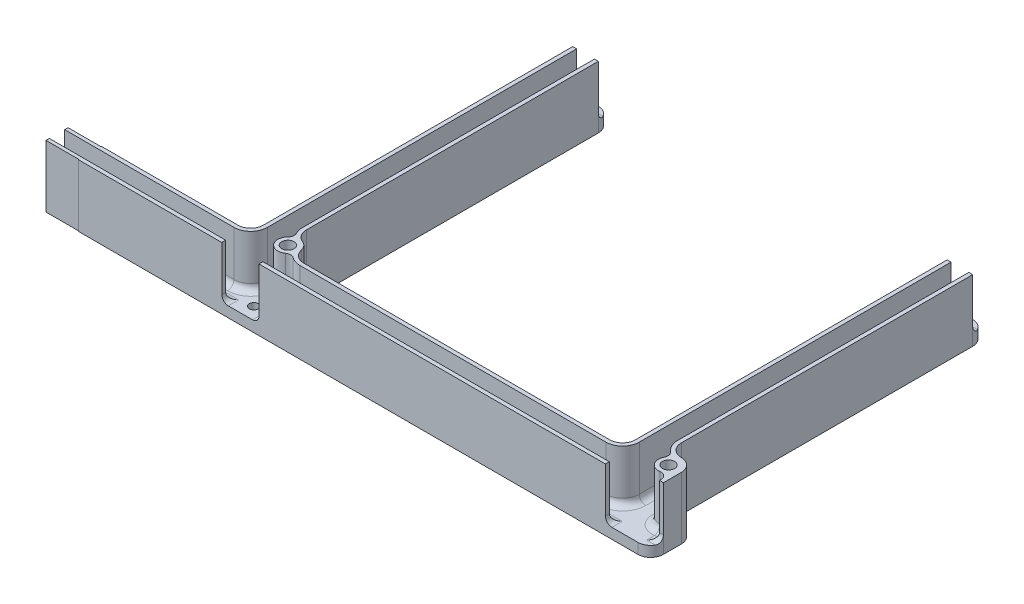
ISO-10303-21;
HEADER;
FILE_DESCRIPTION(('STEP AP214'),'2;1');
FILE_NAME('part.step','',(''),(''),'','','');
FILE_SCHEMA(('AUTOMOTIVE_DESIGN { 1 0 10303 214 1 1 1 1 }'));
ENDSEC;
DATA;
#1=APPLICATION_CONTEXT('core data for automotive mechanical design processes');
#2=APPLICATION_PROTOCOL_DEFINITION('international standard','automotive_design',2000,#1);
#3=PRODUCT_CONTEXT('',#1,'mechanical');
#4=PRODUCT('Part','Part','',(#3));
#5=PRODUCT_RELATED_PRODUCT_CATEGORY('part','',(#4));
#6=PRODUCT_DEFINITION_FORMATION('','',#4);
#7=PRODUCT_DEFINITION_CONTEXT('part definition',#1,'design');
#8=PRODUCT_DEFINITION('design','',#6,#7);
#9=PRODUCT_DEFINITION_SHAPE('','',#8);
#10=(LENGTH_UNIT() NAMED_UNIT(*) SI_UNIT(.MILLI.,.METRE.));
#11=(NAMED_UNIT(*) PLANE_ANGLE_UNIT() SI_UNIT($,.RADIAN.));
#12=(NAMED_UNIT(*) SI_UNIT($,.STERADIAN.) SOLID_ANGLE_UNIT());
#13=UNCERTAINTY_MEASURE_WITH_UNIT(LENGTH_MEASURE(1.E-05),#10,'distance_accuracy_value','');
#14=(GEOMETRIC_REPRESENTATION_CONTEXT(3) GLOBAL_UNCERTAINTY_ASSIGNED_CONTEXT((#13)) GLOBAL_UNIT_ASSIGNED_CONTEXT((#10,
#11,#12)) REPRESENTATION_CONTEXT('',''));
#15=CARTESIAN_POINT('',(0.,0.,0.));
#16=DIRECTION('',(0.,0.,1.));
#17=DIRECTION('',(1.,0.,0.));
#18=AXIS2_PLACEMENT_3D('',#15,#16,#17);
#19=CARTESIAN_POINT('',(0.,24.13,0.));
#20=DIRECTION('',(0.,1.,0.));
#21=DIRECTION('',(0.,0.,1.));
#22=AXIS2_PLACEMENT_3D('',#19,#20,#21);
#23=PLANE('',#22);
#24=DIRECTION('',(-1.,0.,0.));
#25=VECTOR('',#24,1.);
#26=CARTESIAN_POINT('',(0.,24.13,69.6669359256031));
#27=LINE('',#26,#25);
#28=CARTESIAN_POINT('',(-68.6766962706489,24.13,69.6669359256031));
#29=VERTEX_POINT('',#28);
#30=CARTESIAN_POINT('',(-81.5766962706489,24.1300000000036,69.6669359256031));
#31=VERTEX_POINT('',#30);
#32=EDGE_CURVE('E72',#29,#31,#27,.T.);
#33=ORIENTED_EDGE('',*,*,#32,.F.);
#34=DIRECTION('',(0.,0.,1.));
#35=VECTOR('',#34,1.);
#36=CARTESIAN_POINT('',(-68.6766962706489,24.13,0.));
#37=LINE('',#36,#35);
#38=CARTESIAN_POINT('',(-68.6766962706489,24.13,69.8669359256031));
#39=VERTEX_POINT('',#38);
#40=EDGE_CURVE('E488',#29,#39,#37,.T.);
#41=ORIENTED_EDGE('',*,*,#40,.T.);
#42=DIRECTION('',(-1.,0.,0.));
#43=VECTOR('',#42,1.);
#44=CARTESIAN_POINT('',(0.,24.13,69.8669359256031));
#45=LINE('',#44,#43);
#46=CARTESIAN_POINT('',(-12.6260452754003,24.13,69.8669359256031));
#47=VERTEX_POINT('',#46);
#48=EDGE_CURVE('E782',#47,#39,#45,.T.);
#49=ORIENTED_EDGE('',*,*,#48,.F.);
#50=DIRECTION('',(0.,0.,-1.));
#51=VECTOR('',#50,1.);
#52=CARTESIAN_POINT('',(-12.6260452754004,24.13,94.7759499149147));
#53=LINE('',#52,#51);
#54=CARTESIAN_POINT('',(-12.6260452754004,24.13,68.3429359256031));
#55=VERTEX_POINT('',#54);
#56=EDGE_CURVE('E661',#47,#55,#53,.T.);
#57=ORIENTED_EDGE('',*,*,#56,.T.);
#58=DIRECTION('',(1.,0.,0.));
#59=VECTOR('',#58,1.);
#60=CARTESIAN_POINT('',(150.140385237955,24.13,68.342935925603));
#61=LINE('',#60,#59);
#62=CARTESIAN_POINT('',(-81.5766962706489,24.1300000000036,68.3429359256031));
#63=VERTEX_POINT('',#62);
#64=EDGE_CURVE('E771',#63,#55,#61,.T.);
#65=ORIENTED_EDGE('',*,*,#64,.F.);
#66=DIRECTION('',(0.,0.,1.));
#67=VECTOR('',#66,1.);
#68=CARTESIAN_POINT('',(-81.5766962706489,24.1300000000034,0.));
#69=LINE('',#68,#67);
#70=EDGE_CURVE('E612',#63,#31,#69,.T.);
#71=ORIENTED_EDGE('',*,*,#70,.T.);
#72=EDGE_LOOP('',(#33,#41,#49,#57,#65,#71));
#73=FACE_BOUND('',#72,.T.);
#74=ADVANCED_FACE('F56',(#73),#23,.T.);
#75=CARTESIAN_POINT('',(0.,24.13,69.8669359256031));
#76=DIRECTION('',(0.,0.,1.));
#77=DIRECTION('',(1.,0.,0.));
#78=AXIS2_PLACEMENT_3D('',#75,#76,#77);
#79=PLANE('',#78);
#80=ORIENTED_EDGE('',*,*,#48,.T.);
#81=DIRECTION('',(0.,1.,0.));
#82=VECTOR('',#81,1.);
#83=CARTESIAN_POINT('',(-68.6766962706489,1.13412399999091,69.8669359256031));
#84=LINE('',#83,#82);
#85=CARTESIAN_POINT('',(-68.6766962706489,-0.161276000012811,69.8669359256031));
#86=VERTEX_POINT('',#85);
#87=EDGE_CURVE('E609',#86,#39,#84,.T.);
#88=ORIENTED_EDGE('',*,*,#87,.F.);
#89=DIRECTION('',(-1.,0.,0.));
#90=VECTOR('',#89,1.);
#91=CARTESIAN_POINT('',(150.140385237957,-0.161276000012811,69.866935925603));
#92=LINE('',#91,#90);
#93=CARTESIAN_POINT('',(150.140385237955,-0.161276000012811,69.866935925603));
#94=VERTEX_POINT('',#93);
#95=EDGE_CURVE('E505',#94,#86,#92,.T.);
#96=ORIENTED_EDGE('',*,*,#95,.F.);
#97=DIRECTION('',(0.,-1.,0.));
#98=VECTOR('',#97,1.);
#99=CARTESIAN_POINT('',(150.140385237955,24.13,69.8669359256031));
#100=LINE('',#99,#98);
#101=CARTESIAN_POINT('',(150.140385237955,3.92812399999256,69.8669359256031));
#102=VERTEX_POINT('',#101);
#103=EDGE_CURVE('E898',#102,#94,#100,.T.);
#104=ORIENTED_EDGE('',*,*,#103,.F.);
#105=DIRECTION('',(1.,0.,0.));
#106=VECTOR('',#105,1.);
#107=CARTESIAN_POINT('',(-1.28434399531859E-13,3.92812399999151,69.8669359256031));
#108=LINE('',#107,#106);
#109=CARTESIAN_POINT('',(139.980385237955,3.92812399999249,69.8669359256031));
#110=VERTEX_POINT('',#109);
#111=EDGE_CURVE('E689',#110,#102,#108,.T.);
#112=ORIENTED_EDGE('',*,*,#111,.F.);
#113=CARTESIAN_POINT('',(139.980385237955,6.46812399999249,69.8669359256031));
#114=DIRECTION('',(0.,0.,1.));
#115=DIRECTION('',(1.,0.,0.));
#116=AXIS2_PLACEMENT_3D('',#113,#114,#115);
#117=CIRCLE('',#116,2.54);
#118=CARTESIAN_POINT('',(137.440385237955,6.46812399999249,69.8669359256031));
#119=VERTEX_POINT('',#118);
#120=EDGE_CURVE('E1131',#110,#119,#117,.F.);
#121=ORIENTED_EDGE('',*,*,#120,.T.);
#122=DIRECTION('',(0.,1.,0.));
#123=VECTOR('',#122,1.);
#124=CARTESIAN_POINT('',(137.440385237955,-14.4645375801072,69.8669359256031));
#125=LINE('',#124,#123);
#126=CARTESIAN_POINT('',(137.440385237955,24.13,69.8669359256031));
#127=VERTEX_POINT('',#126);
#128=EDGE_CURVE('E685',#119,#127,#125,.T.);
#129=ORIENTED_EDGE('',*,*,#128,.T.);
#130=CARTESIAN_POINT('',(1.94595472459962,24.13,69.8669359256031));
#131=VERTEX_POINT('',#130);
#132=EDGE_CURVE('E783',#127,#131,#45,.T.);
#133=ORIENTED_EDGE('',*,*,#132,.T.);
#134=DIRECTION('',(0.,-1.,0.));
#135=VECTOR('',#134,1.);
#136=CARTESIAN_POINT('',(1.94595472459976,3.92812399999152,69.8669359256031));
#137=LINE('',#136,#135);
#138=CARTESIAN_POINT('',(1.94595472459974,6.46812399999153,69.8669359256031));
#139=VERTEX_POINT('',#138);
#140=EDGE_CURVE('E666',#131,#139,#137,.T.);
#141=ORIENTED_EDGE('',*,*,#140,.T.);
#142=CARTESIAN_POINT('',(-0.594045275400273,6.46812399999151,69.8669359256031));
#143=DIRECTION('',(0.,0.,1.));
#144=DIRECTION('',(1.,0.,0.));
#145=AXIS2_PLACEMENT_3D('',#142,#143,#144);
#146=CIRCLE('',#145,2.54);
#147=CARTESIAN_POINT('',(-0.594045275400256,3.9281239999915,69.8669359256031));
#148=VERTEX_POINT('',#147);
#149=EDGE_CURVE('E1177',#139,#148,#146,.F.);
#150=ORIENTED_EDGE('',*,*,#149,.T.);
#151=DIRECTION('',(-1.,0.,0.));
#152=VECTOR('',#151,1.);
#153=CARTESIAN_POINT('',(-12.6260452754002,3.92812399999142,69.8669359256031));
#154=LINE('',#153,#152);
#155=CARTESIAN_POINT('',(-10.0860452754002,3.92812399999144,69.8669359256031));
#156=VERTEX_POINT('',#155);
#157=EDGE_CURVE('E662',#148,#156,#154,.T.);
#158=ORIENTED_EDGE('',*,*,#157,.T.);
#159=CARTESIAN_POINT('',(-10.0860452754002,6.46812399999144,69.8669359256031));
#160=DIRECTION('',(0.,0.,1.));
#161=DIRECTION('',(1.,0.,0.));
#162=AXIS2_PLACEMENT_3D('',#159,#160,#161);
#163=CIRCLE('',#162,2.54);
#164=CARTESIAN_POINT('',(-12.6260452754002,6.46812399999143,69.8669359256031));
#165=VERTEX_POINT('',#164);
#166=EDGE_CURVE('E1460',#156,#165,#163,.F.);
#167=ORIENTED_EDGE('',*,*,#166,.T.);
#168=DIRECTION('',(0.,1.,0.));
#169=VECTOR('',#168,1.);
#170=CARTESIAN_POINT('',(-12.6260452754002,6.46812399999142,69.8669359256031));
#171=LINE('',#170,#169);
#172=EDGE_CURVE('E659',#165,#47,#171,.T.);
#173=ORIENTED_EDGE('',*,*,#172,.T.);
#174=EDGE_LOOP('',(#80,#88,#96,#104,#112,#121,#129,#133,#141,#150,#158,#167,#173));
#175=FACE_BOUND('',#174,.T.);
#176=ADVANCED_FACE('F1074',(#175),#79,.T.);
#177=CARTESIAN_POINT('',(0.,24.13,60.8439918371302));
#178=DIRECTION('',(0.,0.,-1.));
#179=DIRECTION('',(-1.,0.,0.));
#180=AXIS2_PLACEMENT_3D('',#177,#178,#179);
#181=PLANE('',#180);
#182=DIRECTION('',(0.,-1.,0.));
#183=VECTOR('',#182,1.);
#184=CARTESIAN_POINT('',(-15.3400452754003,24.13,60.8439918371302));
#185=LINE('',#184,#183);
#186=CARTESIAN_POINT('',(-15.3400452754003,24.13,60.8439918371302));
#187=VERTEX_POINT('',#186);
#188=CARTESIAN_POINT('',(-15.3400452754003,-0.161276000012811,60.8439918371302));
#189=VERTEX_POINT('',#188);
#190=EDGE_CURVE('E840',#187,#189,#185,.T.);
#191=ORIENTED_EDGE('',*,*,#190,.T.);
#192=DIRECTION('',(1.,0.,0.));
#193=VECTOR('',#192,1.);
#194=CARTESIAN_POINT('',(-68.676696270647,-0.161276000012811,60.84399183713));
#195=LINE('',#194,#193);
#196=CARTESIAN_POINT('',(-68.6766962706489,-0.161276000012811,60.84399183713));
#197=VERTEX_POINT('',#196);
#198=EDGE_CURVE('E582',#197,#189,#195,.T.);
#199=ORIENTED_EDGE('',*,*,#198,.F.);
#200=DIRECTION('',(0.,1.,0.));
#201=VECTOR('',#200,1.);
#202=CARTESIAN_POINT('',(-68.6766962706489,1.13412399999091,60.84399183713));
#203=LINE('',#202,#201);
#204=CARTESIAN_POINT('',(-68.6766962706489,24.13,60.84399183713));
#205=VERTEX_POINT('',#204);
#206=EDGE_CURVE('E625',#197,#205,#203,.T.);
#207=ORIENTED_EDGE('',*,*,#206,.T.);
#208=DIRECTION('',(1.,0.,0.));
#209=VECTOR('',#208,1.);
#210=CARTESIAN_POINT('',(0.,24.13,60.8439918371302));
#211=LINE('',#210,#209);
#212=EDGE_CURVE('E837',#205,#187,#211,.T.);
#213=ORIENTED_EDGE('',*,*,#212,.T.);
#214=EDGE_LOOP('',(#191,#199,#207,#213));
#215=FACE_BOUND('',#214,.T.);
#216=ADVANCED_FACE('F1081',(#215),#181,.T.);
#217=DIRECTION('',(0.,0.,1.));
#218=VECTOR('',#217,1.);
#219=CARTESIAN_POINT('',(-68.6766962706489,24.13,0.));
#220=LINE('',#219,#218);
#221=CARTESIAN_POINT('',(-68.6766962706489,24.13,61.04399183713));
#222=VERTEX_POINT('',#221);
#223=EDGE_CURVE('E618',#205,#222,#220,.T.);
#224=ORIENTED_EDGE('',*,*,#223,.T.);
#225=DIRECTION('',(-1.,0.,0.));
#226=VECTOR('',#225,1.);
#227=CARTESIAN_POINT('',(0.,24.13,61.04399183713));
#228=LINE('',#227,#226);
#229=CARTESIAN_POINT('',(-81.5766962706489,24.13,61.04399183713));
#230=VERTEX_POINT('',#229);
#231=EDGE_CURVE('E603',#222,#230,#228,.T.);
#232=ORIENTED_EDGE('',*,*,#231,.T.);
#233=CARTESIAN_POINT('',(-81.5766962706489,24.1300000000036,62.3679918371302));
#234=VERTEX_POINT('',#233);
#235=EDGE_CURVE('E631',#230,#234,#69,.T.);
#236=ORIENTED_EDGE('',*,*,#235,.T.);
#237=DIRECTION('',(-1.,0.,0.));
#238=VECTOR('',#237,1.);
#239=CARTESIAN_POINT('',(-138.474637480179,24.13,62.3679918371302));
#240=LINE('',#239,#238);
#241=CARTESIAN_POINT('',(-15.3400452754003,24.13,62.3679918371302));
#242=VERTEX_POINT('',#241);
#243=EDGE_CURVE('E766',#242,#234,#240,.T.);
#244=ORIENTED_EDGE('',*,*,#243,.F.);
#245=CARTESIAN_POINT('',(-15.3400452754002,24.13,55.8439918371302));
#246=DIRECTION('',(0.,-1.,0.));
#247=DIRECTION('',(0.,0.,1.));
#248=AXIS2_PLACEMENT_3D('',#245,#246,#247);
#249=CIRCLE('',#248,6.524);
#250=CARTESIAN_POINT('',(-8.81604527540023,24.13,55.8439918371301));
#251=VERTEX_POINT('',#250);
#252=EDGE_CURVE('E762',#251,#242,#249,.T.);
#253=ORIENTED_EDGE('',*,*,#252,.F.);
#254=DIRECTION('',(0.,0.,1.));
#255=VECTOR('',#254,1.);
#256=CARTESIAN_POINT('',(-8.81604527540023,24.13,55.8439918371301));
#257=LINE('',#256,#255);
#258=CARTESIAN_POINT('',(-8.81604527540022,24.13,-65.1330640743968));
#259=VERTEX_POINT('',#258);
#260=EDGE_CURVE('E758',#259,#251,#257,.T.);
#261=ORIENTED_EDGE('',*,*,#260,.F.);
#262=DIRECTION('',(1.,0.,0.));
#263=VECTOR('',#262,1.);
#264=CARTESIAN_POINT('',(-8.81604527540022,24.13,-65.1330640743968));
#265=LINE('',#264,#263);
#266=CARTESIAN_POINT('',(-10.3400452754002,24.13,-65.1330640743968));
#267=VERTEX_POINT('',#266);
#268=EDGE_CURVE('E712',#267,#259,#265,.T.);
#269=ORIENTED_EDGE('',*,*,#268,.F.);
#270=DIRECTION('',(0.,0.,-1.));
#271=VECTOR('',#270,1.);
#272=CARTESIAN_POINT('',(-10.3400452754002,24.13,0.));
#273=LINE('',#272,#271);
#274=CARTESIAN_POINT('',(-10.3400452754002,24.13,55.8439918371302));
#275=VERTEX_POINT('',#274);
#276=EDGE_CURVE('E829',#275,#267,#273,.T.);
#277=ORIENTED_EDGE('',*,*,#276,.F.);
#278=CARTESIAN_POINT('',(-15.3400452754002,24.13,55.8439918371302));
#279=DIRECTION('',(0.,1.,0.));
#280=DIRECTION('',(0.,0.,1.));
#281=AXIS2_PLACEMENT_3D('',#278,#279,#280);
#282=CIRCLE('',#281,5.);
#283=EDGE_CURVE('E833',#275,#187,#282,.F.);
#284=ORIENTED_EDGE('',*,*,#283,.T.);
#285=ORIENTED_EDGE('',*,*,#212,.F.);
#286=EDGE_LOOP('',(#224,#232,#236,#244,#253,#261,#269,#277,#284,#285));
#287=FACE_BOUND('',#286,.T.);
#288=ADVANCED_FACE('F1077',(#287),#23,.T.);
#289=CARTESIAN_POINT('',(-81.5766962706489,24.1300000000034,0.));
#290=DIRECTION('',(1.,0.,0.));
#291=DIRECTION('',(0.,1.,0.));
#292=AXIS2_PLACEMENT_3D('',#289,#290,#291);
#293=PLANE('',#292);
#294=DIRECTION('',(0.,1.,0.));
#295=VECTOR('',#294,1.);
#296=CARTESIAN_POINT('',(-81.5766962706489,1.13412399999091,61.04399183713));
#297=LINE('',#296,#295);
#298=CARTESIAN_POINT('',(-81.5766962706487,-0.161276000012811,61.04399183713));
#299=VERTEX_POINT('',#298);
#300=EDGE_CURVE('E606',#299,#230,#297,.T.);
#301=ORIENTED_EDGE('',*,*,#300,.F.);
#302=DIRECTION('',(0.,0.,-1.));
#303=VECTOR('',#302,1.);
#304=CARTESIAN_POINT('',(-81.5766962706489,-0.161276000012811,69.666935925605));
#305=LINE('',#304,#303);
#306=CARTESIAN_POINT('',(-81.5766962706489,-0.161276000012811,69.6669359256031));
#307=VERTEX_POINT('',#306);
#308=EDGE_CURVE('E500',#307,#299,#305,.T.);
#309=ORIENTED_EDGE('',*,*,#308,.F.);
#310=DIRECTION('',(0.,1.,0.));
#311=VECTOR('',#310,1.);
#312=CARTESIAN_POINT('',(-81.5766962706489,1.13412399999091,69.6669359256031));
#313=LINE('',#312,#311);
#314=EDGE_CURVE('E490',#307,#31,#313,.T.);
#315=ORIENTED_EDGE('',*,*,#314,.T.);
#316=ORIENTED_EDGE('',*,*,#70,.F.);
#317=DIRECTION('',(0.,1.,0.));
#318=VECTOR('',#317,1.);
#319=CARTESIAN_POINT('',(-81.5766962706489,24.1299999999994,68.3429359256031));
#320=LINE('',#319,#318);
#321=CARTESIAN_POINT('',(-81.5766962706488,6.46812399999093,68.3429359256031));
#322=VERTEX_POINT('',#321);
#323=EDGE_CURVE('E80',#322,#63,#320,.T.);
#324=ORIENTED_EDGE('',*,*,#323,.F.);
#325=CARTESIAN_POINT('',(-81.5766962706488,6.46812399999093,65.8029359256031));
#326=DIRECTION('',(1.,0.,0.));
#327=DIRECTION('',(0.,1.,0.));
#328=AXIS2_PLACEMENT_3D('',#325,#326,#327);
#329=CIRCLE('',#328,2.54);
#330=CARTESIAN_POINT('',(-81.5766962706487,3.92812399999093,65.8029359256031));
#331=VERTEX_POINT('',#330);
#332=EDGE_CURVE('E12',#331,#322,#329,.F.);
#333=ORIENTED_EDGE('',*,*,#332,.F.);
#334=DIRECTION('',(0.,0.,1.));
#335=VECTOR('',#334,1.);
#336=CARTESIAN_POINT('',(-81.5766962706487,3.92812399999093,64.8153031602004));
#337=LINE('',#336,#335);
#338=CARTESIAN_POINT('',(-81.5766962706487,3.92812399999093,64.9079918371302));
#339=VERTEX_POINT('',#338);
#340=EDGE_CURVE('E636',#339,#331,#337,.T.);
#341=ORIENTED_EDGE('',*,*,#340,.F.);
#342=CARTESIAN_POINT('',(-81.5766962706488,6.46812399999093,64.9079918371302));
#343=DIRECTION('',(1.,0.,0.));
#344=DIRECTION('',(0.,1.,0.));
#345=AXIS2_PLACEMENT_3D('',#342,#343,#344);
#346=CIRCLE('',#345,2.54);
#347=CARTESIAN_POINT('',(-81.5766962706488,6.46812399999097,62.3679918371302));
#348=VERTEX_POINT('',#347);
#349=EDGE_CURVE('E640',#348,#339,#346,.F.);
#350=ORIENTED_EDGE('',*,*,#349,.F.);
#351=DIRECTION('',(0.,-1.,0.));
#352=VECTOR('',#351,1.);
#353=CARTESIAN_POINT('',(-81.5766962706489,24.1299999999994,62.3679918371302));
#354=LINE('',#353,#352);
#355=EDGE_CURVE('E644',#234,#348,#354,.T.);
#356=ORIENTED_EDGE('',*,*,#355,.F.);
#357=ORIENTED_EDGE('',*,*,#235,.F.);
#358=EDGE_LOOP('',(#301,#309,#315,#316,#324,#333,#341,#350,#356,#357));
#359=FACE_BOUND('',#358,.T.);
#360=ADVANCED_FACE('F1087',(#359),#293,.F.);
#361=CARTESIAN_POINT('',(-152.743981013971,3.92812399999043,64.8153031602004));
#362=DIRECTION('',(0.,-1.,0.));
#363=DIRECTION('',(1.,0.,0.));
#364=AXIS2_PLACEMENT_3D('',#361,#362,#363);
#365=PLANE('',#364);
#366=CARTESIAN_POINT('',(-4.92661476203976,3.92812399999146,64.9789359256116));
#367=DIRECTION('',(0.,1.,0.));
#368=DIRECTION('',(-1.,0.,0.));
#369=AXIS2_PLACEMENT_3D('',#366,#367,#368);
#370=CIRCLE('',#369,1.77800000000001);
#371=CARTESIAN_POINT('',(-6.70461476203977,3.92812399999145,64.9789359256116));
#372=VERTEX_POINT('',#371);
#373=EDGE_CURVE('E499',#372,#372,#370,.T.);
#374=ORIENTED_EDGE('',*,*,#373,.F.);
#375=EDGE_LOOP('',(#374));
#376=FACE_BOUND('',#375,.T.);
#377=DIRECTION('',(-1.,0.,0.));
#378=VECTOR('',#377,1.);
#379=CARTESIAN_POINT('',(-138.474637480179,3.92812399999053,64.9079918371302));
#380=LINE('',#379,#378);
#381=CARTESIAN_POINT('',(-15.3400452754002,3.92812399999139,64.9079918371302));
#382=VERTEX_POINT('',#381);
#383=EDGE_CURVE('E1183',#382,#339,#380,.T.);
#384=ORIENTED_EDGE('',*,*,#383,.T.);
#385=ORIENTED_EDGE('',*,*,#340,.T.);
#386=DIRECTION('',(1.,0.,0.));
#387=VECTOR('',#386,1.);
#388=CARTESIAN_POINT('',(-10.0860452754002,3.92812399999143,65.8029359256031));
#389=LINE('',#388,#387);
#390=CARTESIAN_POINT('',(-10.0860452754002,3.92812399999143,65.8029359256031));
#391=VERTEX_POINT('',#390);
#392=EDGE_CURVE('E1190',#331,#391,#389,.T.);
#393=ORIENTED_EDGE('',*,*,#392,.T.);
#394=DIRECTION('',(0.,0.,-1.));
#395=VECTOR('',#394,1.);
#396=CARTESIAN_POINT('',(-10.0860452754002,3.92812399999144,69.8669359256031));
#397=LINE('',#396,#395);
#398=EDGE_CURVE('E1149',#391,#156,#397,.F.);
#399=ORIENTED_EDGE('',*,*,#398,.T.);
#400=ORIENTED_EDGE('',*,*,#157,.F.);
#401=DIRECTION('',(0.,0.,-1.));
#402=VECTOR('',#401,1.);
#403=CARTESIAN_POINT('',(-0.594045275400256,3.9281239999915,68.3429359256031));
#404=LINE('',#403,#402);
#405=CARTESIAN_POINT('',(-0.594045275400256,3.9281239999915,65.8029359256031));
#406=VERTEX_POINT('',#405);
#407=EDGE_CURVE('E1373',#148,#406,#404,.T.);
#408=ORIENTED_EDGE('',*,*,#407,.T.);
#409=DIRECTION('',(1.,0.,0.));
#410=VECTOR('',#409,1.);
#411=CARTESIAN_POINT('',(139.980385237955,3.92812399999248,65.8029359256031));
#412=LINE('',#411,#410);
#413=CARTESIAN_POINT('',(139.980385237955,3.92812399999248,65.8029359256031));
#414=VERTEX_POINT('',#413);
#415=EDGE_CURVE('E1191',#406,#414,#412,.T.);
#416=ORIENTED_EDGE('',*,*,#415,.T.);
#417=DIRECTION('',(0.,0.,1.));
#418=VECTOR('',#417,1.);
#419=CARTESIAN_POINT('',(139.980385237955,3.92812399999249,69.8669359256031));
#420=LINE('',#419,#418);
#421=EDGE_CURVE('E1147',#414,#110,#420,.T.);
#422=ORIENTED_EDGE('',*,*,#421,.T.);
#423=ORIENTED_EDGE('',*,*,#111,.T.);
#424=CARTESIAN_POINT('',(150.140385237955,3.92812399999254,64.8669359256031));
#425=DIRECTION('',(0.,-1.,0.));
#426=DIRECTION('',(1.,0.,0.));
#427=AXIS2_PLACEMENT_3D('',#424,#425,#426);
#428=CIRCLE('',#427,4.99999999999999);
#429=CARTESIAN_POINT('',(154.447170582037,3.92812399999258,67.4069359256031));
#430=VERTEX_POINT('',#429);
#431=EDGE_CURVE('E681',#102,#430,#428,.F.);
#432=ORIENTED_EDGE('',*,*,#431,.T.);
#433=DIRECTION('',(1.,0.,0.));
#434=VECTOR('',#433,1.);
#435=CARTESIAN_POINT('',(-152.743981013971,3.92812399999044,67.4069359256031));
#436=LINE('',#435,#434);
#437=CARTESIAN_POINT('',(151.076385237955,3.92812399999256,67.4069359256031));
#438=VERTEX_POINT('',#437);
#439=EDGE_CURVE('E1150',#430,#438,#436,.F.);
#440=ORIENTED_EDGE('',*,*,#439,.T.);
#441=DIRECTION('',(0.,0.,1.));
#442=VECTOR('',#441,1.);
#443=CARTESIAN_POINT('',(151.076385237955,3.92812399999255,64.8153031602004));
#444=LINE('',#443,#442);
#445=CARTESIAN_POINT('',(151.076385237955,3.92812399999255,64.271096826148));
#446=VERTEX_POINT('',#445);
#447=EDGE_CURVE('E1192',#438,#446,#444,.F.);
#448=ORIENTED_EDGE('',*,*,#447,.T.);
#449=CARTESIAN_POINT('',(150.140385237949,3.92812399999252,57.8669359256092));
#450=DIRECTION('',(0.,-1.,0.));
#451=DIRECTION('',(1.,0.,0.));
#452=AXIS2_PLACEMENT_3D('',#449,#450,#451);
#453=CIRCLE('',#452,6.47220000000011);
#454=CARTESIAN_POINT('',(144.398502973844,3.92812399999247,54.8802720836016));
#455=VERTEX_POINT('',#454);
#456=EDGE_CURVE('E1210',#446,#455,#453,.T.);
#457=ORIENTED_EDGE('',*,*,#456,.T.);
#458=CARTESIAN_POINT('',(150.140385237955,3.92812399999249,47.8669359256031));
#459=DIRECTION('',(0.,-1.,0.));
#460=DIRECTION('',(1.,0.,0.));
#461=AXIS2_PLACEMENT_3D('',#458,#459,#460);
#462=CIRCLE('',#461,9.064);
#463=CARTESIAN_POINT('',(141.076385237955,3.92812399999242,47.8669359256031));
#464=VERTEX_POINT('',#463);
#465=EDGE_CURVE('E1209',#455,#464,#462,.T.);
#466=ORIENTED_EDGE('',*,*,#465,.T.);
#467=DIRECTION('',(0.,0.,-1.));
#468=VECTOR('',#467,1.);
#469=CARTESIAN_POINT('',(141.076385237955,3.92812399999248,64.8153031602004));
#470=LINE('',#469,#468);
#471=CARTESIAN_POINT('',(141.076385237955,3.92812399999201,-68.650119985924));
#472=VERTEX_POINT('',#471);
#473=EDGE_CURVE('E1211',#464,#472,#470,.T.);
#474=ORIENTED_EDGE('',*,*,#473,.T.);
#475=DIRECTION('',(1.,0.,0.));
#476=VECTOR('',#475,1.);
#477=CARTESIAN_POINT('',(145.140385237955,3.92812399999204,-68.650119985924));
#478=LINE('',#477,#476);
#479=CARTESIAN_POINT('',(144.447170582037,3.92812399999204,-68.650119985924));
#480=VERTEX_POINT('',#479);
#481=EDGE_CURVE('E906',#472,#480,#478,.T.);
#482=ORIENTED_EDGE('',*,*,#481,.T.);
#483=CARTESIAN_POINT('',(140.140385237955,3.92812399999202,-66.110119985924));
#484=DIRECTION('',(0.,-1.,0.));
#485=DIRECTION('',(1.,0.,0.));
#486=AXIS2_PLACEMENT_3D('',#483,#484,#485);
#487=CIRCLE('',#486,4.99999999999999);
#488=CARTESIAN_POINT('',(135.833599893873,3.92812399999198,-68.650119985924));
#489=VERTEX_POINT('',#488);
#490=EDGE_CURVE('E700',#480,#489,#487,.F.);
#491=ORIENTED_EDGE('',*,*,#490,.T.);
#492=DIRECTION('',(1.,0.,0.));
#493=VECTOR('',#492,1.);
#494=CARTESIAN_POINT('',(136.664385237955,3.92812399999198,-68.650119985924));
#495=LINE('',#494,#493);
#496=CARTESIAN_POINT('',(139.204385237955,3.928123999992,-68.650119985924));
#497=VERTEX_POINT('',#496);
#498=EDGE_CURVE('E953',#489,#497,#495,.T.);
#499=ORIENTED_EDGE('',*,*,#498,.T.);
#500=DIRECTION('',(0.,0.,-1.));
#501=VECTOR('',#500,1.);
#502=CARTESIAN_POINT('',(139.204385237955,3.92812399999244,55.8439918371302));
#503=LINE('',#502,#501);
#504=CARTESIAN_POINT('',(139.204385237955,3.92812399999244,55.8439918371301));
#505=VERTEX_POINT('',#504);
#506=EDGE_CURVE('E1336',#497,#505,#503,.F.);
#507=ORIENTED_EDGE('',*,*,#506,.T.);
#508=CARTESIAN_POINT('',(130.140385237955,3.92812399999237,55.8439918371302));
#509=DIRECTION('',(0.,-1.,0.));
#510=DIRECTION('',(1.,0.,0.));
#511=AXIS2_PLACEMENT_3D('',#508,#509,#510);
#512=CIRCLE('',#511,9.064);
#513=CARTESIAN_POINT('',(130.140385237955,3.92812399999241,64.9079918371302));
#514=VERTEX_POINT('',#513);
#515=EDGE_CURVE('E1188',#505,#514,#512,.T.);
#516=ORIENTED_EDGE('',*,*,#515,.T.);
#517=DIRECTION('',(-1.,0.,0.));
#518=VECTOR('',#517,1.);
#519=CARTESIAN_POINT('',(10.4263625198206,3.92812399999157,64.9079918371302));
#520=LINE('',#519,#518);
#521=CARTESIAN_POINT('',(10.4263625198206,3.92812399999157,64.9079918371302));
#522=VERTEX_POINT('',#521);
#523=EDGE_CURVE('E1185',#514,#522,#520,.T.);
#524=ORIENTED_EDGE('',*,*,#523,.T.);
#525=CARTESIAN_POINT('',(10.4263625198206,3.92812399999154,55.8439918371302));
#526=DIRECTION('',(0.,-1.,0.));
#527=DIRECTION('',(1.,0.,0.));
#528=AXIS2_PLACEMENT_3D('',#525,#526,#527);
#529=CIRCLE('',#528,9.06400000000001);
#530=CARTESIAN_POINT('',(5.01431677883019,3.92812399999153,63.1148829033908));
#531=VERTEX_POINT('',#530);
#532=EDGE_CURVE('E1187',#522,#531,#529,.T.);
#533=ORIENTED_EDGE('',*,*,#532,.T.);
#534=CARTESIAN_POINT('',(1.22638523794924,3.92812399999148,57.8669359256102));
#535=DIRECTION('',(0.,-1.,0.));
#536=DIRECTION('',(1.,0.,0.));
#537=AXIS2_PLACEMENT_3D('',#534,#535,#536);
#538=CIRCLE('',#537,6.47219999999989);
#539=CARTESIAN_POINT('',(-3.36629233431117,3.92812399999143,53.306597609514));
#540=VERTEX_POINT('',#539);
#541=EDGE_CURVE('E1236',#531,#540,#538,.T.);
#542=ORIENTED_EDGE('',*,*,#541,.T.);
#543=CARTESIAN_POINT('',(4.65995472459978,3.92812399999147,49.0952493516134));
#544=DIRECTION('',(0.,-1.,0.));
#545=DIRECTION('',(1.,0.,0.));
#546=AXIS2_PLACEMENT_3D('',#543,#544,#545);
#547=CIRCLE('',#546,9.064);
#548=CARTESIAN_POINT('',(-4.40404527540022,3.92812399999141,49.0952493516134));
#549=VERTEX_POINT('',#548);
#550=EDGE_CURVE('E1237',#540,#549,#547,.T.);
#551=ORIENTED_EDGE('',*,*,#550,.T.);
#552=DIRECTION('',(0.,0.,-1.));
#553=VECTOR('',#552,1.);
#554=CARTESIAN_POINT('',(-4.40404527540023,3.92812399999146,64.8153031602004));
#555=LINE('',#554,#553);
#556=CARTESIAN_POINT('',(-4.40404527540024,3.928123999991,-67.6730640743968));
#557=VERTEX_POINT('',#556);
#558=EDGE_CURVE('E1371',#549,#557,#555,.T.);
#559=ORIENTED_EDGE('',*,*,#558,.T.);
#560=DIRECTION('',(1.,0.,0.));
#561=VECTOR('',#560,1.);
#562=CARTESIAN_POINT('',(-0.340045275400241,3.92812399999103,-67.6730640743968));
#563=LINE('',#562,#561);
#564=CARTESIAN_POINT('',(-1.03325993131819,3.92812399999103,-67.6730640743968));
#565=VERTEX_POINT('',#564);
#566=EDGE_CURVE('E964',#557,#565,#563,.T.);
#567=ORIENTED_EDGE('',*,*,#566,.T.);
#568=CARTESIAN_POINT('',(-5.34004527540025,3.928123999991,-65.1330640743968));
#569=DIRECTION('',(0.,-1.,0.));
#570=DIRECTION('',(1.,0.,0.));
#571=AXIS2_PLACEMENT_3D('',#568,#569,#570);
#572=CIRCLE('',#571,4.99999999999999);
#573=CARTESIAN_POINT('',(-9.6468306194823,3.92812399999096,-67.6730640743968));
#574=VERTEX_POINT('',#573);
#575=EDGE_CURVE('E696',#565,#574,#572,.F.);
#576=ORIENTED_EDGE('',*,*,#575,.T.);
#577=DIRECTION('',(1.,0.,0.));
#578=VECTOR('',#577,1.);
#579=CARTESIAN_POINT('',(-8.81604527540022,3.92812399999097,-67.6730640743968));
#580=LINE('',#579,#578);
#581=CARTESIAN_POINT('',(-6.27604527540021,3.92812399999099,-67.6730640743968));
#582=VERTEX_POINT('',#581);
#583=EDGE_CURVE('E968',#574,#582,#580,.T.);
#584=ORIENTED_EDGE('',*,*,#583,.T.);
#585=DIRECTION('',(0.,0.,-1.));
#586=VECTOR('',#585,1.);
#587=CARTESIAN_POINT('',(-6.27604527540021,3.92812399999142,55.8439918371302));
#588=LINE('',#587,#586);
#589=CARTESIAN_POINT('',(-6.27604527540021,3.92812399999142,55.8439918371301));
#590=VERTEX_POINT('',#589);
#591=EDGE_CURVE('E1182',#582,#590,#588,.F.);
#592=ORIENTED_EDGE('',*,*,#591,.T.);
#593=CARTESIAN_POINT('',(-15.3400452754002,3.92812399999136,55.8439918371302));
#594=DIRECTION('',(0.,-1.,0.));
#595=DIRECTION('',(1.,0.,0.));
#596=AXIS2_PLACEMENT_3D('',#593,#594,#595);
#597=CIRCLE('',#596,9.064);
#598=EDGE_CURVE('E1180',#590,#382,#597,.T.);
#599=ORIENTED_EDGE('',*,*,#598,.T.);
#600=EDGE_LOOP('',(#384,#385,#393,#399,#400,#408,#416,#422,#423,#432,#440,#448,#457,#466,#474,
#482,#491,#499,#507,#516,#524,#533,#542,#551,#559,#567,#576,#584,#592,#599));
#601=FACE_BOUND('',#600,.T.);
#602=ADVANCED_FACE('F1349',(#376,#601),#365,.F.);
#603=CARTESIAN_POINT('',(1.2263852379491,24.1300000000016,57.8669359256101));
#604=DIRECTION('',(0.,-1.,0.));
#605=DIRECTION('',(1.,0.,0.));
#606=AXIS2_PLACEMENT_3D('',#603,#604,#605);
#607=CYLINDRICAL_SURFACE('',#606,3.93219999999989);
#608=DIRECTION('',(0.,-1.,0.));
#609=VECTOR('',#608,1.);
#610=CARTESIAN_POINT('',(-1.56390658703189,24.1300000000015,55.0962918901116));
#611=LINE('',#610,#609);
#612=CARTESIAN_POINT('',(-1.56390658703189,24.13,55.0962918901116));
#613=VERTEX_POINT('',#612);
#614=CARTESIAN_POINT('',(-1.56390658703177,6.46812399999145,55.0962918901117));
#615=VERTEX_POINT('',#614);
#616=EDGE_CURVE('E1178',#613,#615,#611,.T.);
#617=ORIENTED_EDGE('',*,*,#616,.T.);
#618=CARTESIAN_POINT('',(1.22638523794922,6.46812399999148,57.8669359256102));
#619=DIRECTION('',(0.,-1.,0.));
#620=DIRECTION('',(1.,0.,0.));
#621=AXIS2_PLACEMENT_3D('',#618,#619,#620);
#622=CIRCLE('',#621,3.93219999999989);
#623=CARTESIAN_POINT('',(3.52775176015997,6.46812399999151,61.0553381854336));
#624=VERTEX_POINT('',#623);
#625=EDGE_CURVE('E1245',#615,#624,#622,.F.);
#626=ORIENTED_EDGE('',*,*,#625,.T.);
#627=DIRECTION('',(0.,-1.,0.));
#628=VECTOR('',#627,1.);
#629=CARTESIAN_POINT('',(3.52775176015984,24.1300000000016,61.0553381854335));
#630=LINE('',#629,#628);
#631=CARTESIAN_POINT('',(3.52775176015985,24.13,61.0553381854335));
#632=VERTEX_POINT('',#631);
#633=EDGE_CURVE('E1361',#624,#632,#630,.F.);
#634=ORIENTED_EDGE('',*,*,#633,.T.);
#635=CARTESIAN_POINT('',(1.22638523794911,24.13,57.8669359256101));
#636=DIRECTION('',(0.,-1.,0.));
#637=DIRECTION('',(0.,0.,1.));
#638=AXIS2_PLACEMENT_3D('',#635,#636,#637);
#639=CIRCLE('',#638,3.93219999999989);
#640=EDGE_CURVE('E747',#632,#613,#639,.T.);
#641=ORIENTED_EDGE('',*,*,#640,.T.);
#642=EDGE_LOOP('',(#617,#626,#634,#641));
#643=FACE_BOUND('',#642,.T.);
#644=ADVANCED_FACE('F1679',(#643),#607,.T.);
#645=CARTESIAN_POINT('',(-15.3400452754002,24.13,55.8439918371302));
#646=DIRECTION('',(0.,-1.,0.));
#647=DIRECTION('',(0.,0.,-1.));
#648=AXIS2_PLACEMENT_3D('',#645,#646,#647);
#649=CYLINDRICAL_SURFACE('',#648,6.524);
#650=DIRECTION('',(0.,1.,0.));
#651=VECTOR('',#650,1.);
#652=CARTESIAN_POINT('',(-15.3400452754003,24.13,62.3679918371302));
#653=LINE('',#652,#651);
#654=CARTESIAN_POINT('',(-15.3400452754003,6.46812399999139,62.3679918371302));
#655=VERTEX_POINT('',#654);
#656=EDGE_CURVE('E902',#242,#655,#653,.F.);
#657=ORIENTED_EDGE('',*,*,#656,.T.);
#658=CARTESIAN_POINT('',(-15.3400452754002,6.46812399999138,55.8439918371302));
#659=DIRECTION('',(0.,-1.,0.));
#660=DIRECTION('',(1.,0.,0.));
#661=AXIS2_PLACEMENT_3D('',#658,#659,#660);
#662=CIRCLE('',#661,6.524);
#663=CARTESIAN_POINT('',(-8.81604527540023,6.46812399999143,55.8439918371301));
#664=VERTEX_POINT('',#663);
#665=EDGE_CURVE('E1263',#655,#664,#662,.F.);
#666=ORIENTED_EDGE('',*,*,#665,.T.);
#667=DIRECTION('',(0.,-1.,0.));
#668=VECTOR('',#667,1.);
#669=CARTESIAN_POINT('',(-8.81604527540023,24.13,55.8439918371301));
#670=LINE('',#669,#668);
#671=EDGE_CURVE('E907',#251,#664,#670,.T.);
#672=ORIENTED_EDGE('',*,*,#671,.F.);
#673=ORIENTED_EDGE('',*,*,#252,.T.);
#674=EDGE_LOOP('',(#657,#666,#672,#673));
#675=FACE_BOUND('',#674,.T.);
#676=ADVANCED_FACE('F1807',(#675),#649,.T.);
#677=CARTESIAN_POINT('',(10.4263625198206,24.13,55.8439918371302));
#678=DIRECTION('',(0.,-1.,0.));
#679=DIRECTION('',(0.,0.,-1.));
#680=AXIS2_PLACEMENT_3D('',#677,#678,#679);
#681=CYLINDRICAL_SURFACE('',#680,6.52400000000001);
#682=DIRECTION('',(0.,-1.,0.));
#683=VECTOR('',#682,1.);
#684=CARTESIAN_POINT('',(6.53093153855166,24.13,61.0773648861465));
#685=LINE('',#684,#683);
#686=CARTESIAN_POINT('',(6.53093153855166,24.13,61.0773648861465));
#687=VERTEX_POINT('',#686);
#688=CARTESIAN_POINT('',(6.53093153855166,6.46812399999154,61.0773648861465));
#689=VERTEX_POINT('',#688);
#690=EDGE_CURVE('E1174',#687,#689,#685,.T.);
#691=ORIENTED_EDGE('',*,*,#690,.T.);
#692=CARTESIAN_POINT('',(10.4263625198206,6.46812399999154,55.8439918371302));
#693=DIRECTION('',(0.,-1.,0.));
#694=DIRECTION('',(1.,0.,0.));
#695=AXIS2_PLACEMENT_3D('',#692,#693,#694);
#696=CIRCLE('',#695,6.52400000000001);
#697=CARTESIAN_POINT('',(10.4263625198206,6.46812399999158,62.3679918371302));
#698=VERTEX_POINT('',#697);
#699=EDGE_CURVE('E1253',#689,#698,#696,.F.);
#700=ORIENTED_EDGE('',*,*,#699,.T.);
#701=DIRECTION('',(0.,-1.,0.));
#702=VECTOR('',#701,1.);
#703=CARTESIAN_POINT('',(10.4263625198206,24.13,62.3679918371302));
#704=LINE('',#703,#702);
#705=CARTESIAN_POINT('',(10.4263625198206,24.13,62.3679918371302));
#706=VERTEX_POINT('',#705);
#707=EDGE_CURVE('E901',#706,#698,#704,.T.);
#708=ORIENTED_EDGE('',*,*,#707,.F.);
#709=CARTESIAN_POINT('',(10.4263625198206,24.13,55.8439918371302));
#710=DIRECTION('',(0.,-1.,0.));
#711=DIRECTION('',(0.,0.,1.));
#712=AXIS2_PLACEMENT_3D('',#709,#710,#711);
#713=CIRCLE('',#712,6.52400000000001);
#714=EDGE_CURVE('E743',#706,#687,#713,.T.);
#715=ORIENTED_EDGE('',*,*,#714,.T.);
#716=EDGE_LOOP('',(#691,#700,#708,#715));
#717=FACE_BOUND('',#716,.T.);
#718=ADVANCED_FACE('F1435',(#717),#681,.T.);
#719=CARTESIAN_POINT('',(4.65995472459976,24.13,49.0952493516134));
#720=DIRECTION('',(0.,-1.,0.));
#721=DIRECTION('',(0.,0.,-1.));
#722=AXIS2_PLACEMENT_3D('',#719,#720,#721);
#723=CYLINDRICAL_SURFACE('',#722,6.524);
#724=DIRECTION('',(0.,1.,0.));
#725=VECTOR('',#724,1.);
#726=CARTESIAN_POINT('',(-1.86404527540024,24.13,49.0952493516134));
#727=LINE('',#726,#725);
#728=CARTESIAN_POINT('',(-1.86404527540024,24.13,49.0952493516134));
#729=VERTEX_POINT('',#728);
#730=CARTESIAN_POINT('',(-1.86404527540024,6.46812399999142,49.0952493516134));
#731=VERTEX_POINT('',#730);
#732=EDGE_CURVE('E919',#729,#731,#727,.F.);
#733=ORIENTED_EDGE('',*,*,#732,.T.);
#734=CARTESIAN_POINT('',(4.65995472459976,6.46812399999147,49.0952493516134));
#735=DIRECTION('',(0.,-1.,0.));
#736=DIRECTION('',(1.,0.,0.));
#737=AXIS2_PLACEMENT_3D('',#734,#735,#736);
#738=CIRCLE('',#737,6.524);
#739=CARTESIAN_POINT('',(-1.11710130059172,6.46812399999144,52.1264536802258));
#740=VERTEX_POINT('',#739);
#741=EDGE_CURVE('E1142',#731,#740,#738,.F.);
#742=ORIENTED_EDGE('',*,*,#741,.T.);
#743=DIRECTION('',(0.,-1.,0.));
#744=VECTOR('',#743,1.);
#745=CARTESIAN_POINT('',(-1.11710130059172,24.13,52.1264536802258));
#746=LINE('',#745,#744);
#747=CARTESIAN_POINT('',(-1.11710130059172,24.13,52.1264536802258));
#748=VERTEX_POINT('',#747);
#749=EDGE_CURVE('E1360',#740,#748,#746,.F.);
#750=ORIENTED_EDGE('',*,*,#749,.T.);
#751=CARTESIAN_POINT('',(4.65995472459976,24.13,49.0952493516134));
#752=DIRECTION('',(0.,-1.,0.));
#753=DIRECTION('',(0.,0.,1.));
#754=AXIS2_PLACEMENT_3D('',#751,#752,#753);
#755=CIRCLE('',#754,6.524);
#756=EDGE_CURVE('E751',#748,#729,#755,.T.);
#757=ORIENTED_EDGE('',*,*,#756,.T.);
#758=EDGE_LOOP('',(#733,#742,#750,#757));
#759=FACE_BOUND('',#758,.T.);
#760=ADVANCED_FACE('F1722',(#759),#723,.T.);
#761=CARTESIAN_POINT('',(150.140385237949,24.1300000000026,57.8669359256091));
#762=DIRECTION('',(0.,-1.,0.));
#763=DIRECTION('',(1.,0.,0.));
#764=AXIS2_PLACEMENT_3D('',#761,#762,#763);
#765=CYLINDRICAL_SURFACE('',#764,3.93220000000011);
#766=DIRECTION('',(0.,-1.,0.));
#767=VECTOR('',#766,1.);
#768=CARTESIAN_POINT('',(146.651891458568,24.1300000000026,56.0523814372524));
#769=LINE('',#768,#767);
#770=CARTESIAN_POINT('',(146.651891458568,24.13,56.0523814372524));
#771=VERTEX_POINT('',#770);
#772=CARTESIAN_POINT('',(146.651891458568,6.46812399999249,56.0523814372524));
#773=VERTEX_POINT('',#772);
#774=EDGE_CURVE('E1457',#771,#773,#769,.T.);
#775=ORIENTED_EDGE('',*,*,#774,.T.);
#776=CARTESIAN_POINT('',(150.140385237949,6.46812399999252,57.8669359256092));
#777=DIRECTION('',(0.,-1.,0.));
#778=DIRECTION('',(1.,0.,0.));
#779=AXIS2_PLACEMENT_3D('',#776,#777,#778);
#780=CIRCLE('',#779,3.93220000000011);
#781=CARTESIAN_POINT('',(150.709054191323,6.46812399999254,61.7577986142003));
#782=VERTEX_POINT('',#781);
#783=EDGE_CURVE('E1358',#773,#782,#780,.F.);
#784=ORIENTED_EDGE('',*,*,#783,.T.);
#785=DIRECTION('',(0.,-1.,0.));
#786=VECTOR('',#785,1.);
#787=CARTESIAN_POINT('',(150.709054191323,24.1300000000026,61.7577986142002));
#788=LINE('',#787,#786);
#789=CARTESIAN_POINT('',(150.709054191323,24.13,61.7577986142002));
#790=VERTEX_POINT('',#789);
#791=EDGE_CURVE('E1367',#782,#790,#788,.F.);
#792=ORIENTED_EDGE('',*,*,#791,.T.);
#793=CARTESIAN_POINT('',(150.140385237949,24.13,57.8669359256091));
#794=DIRECTION('',(0.,-1.,0.));
#795=DIRECTION('',(0.,0.,1.));
#796=AXIS2_PLACEMENT_3D('',#793,#794,#795);
#797=CIRCLE('',#796,3.93220000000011);
#798=EDGE_CURVE('E720',#790,#771,#797,.T.);
#799=ORIENTED_EDGE('',*,*,#798,.T.);
#800=EDGE_LOOP('',(#775,#784,#792,#799));
#801=FACE_BOUND('',#800,.T.);
#802=ADVANCED_FACE('F1768',(#801),#765,.T.);
#803=CARTESIAN_POINT('',(130.140385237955,24.13,55.8439918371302));
#804=DIRECTION('',(0.,-1.,0.));
#805=DIRECTION('',(0.,0.,-1.));
#806=AXIS2_PLACEMENT_3D('',#803,#804,#805);
#807=CYLINDRICAL_SURFACE('',#806,6.524);
#808=DIRECTION('',(0.,1.,0.));
#809=VECTOR('',#808,1.);
#810=CARTESIAN_POINT('',(130.140385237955,24.13,62.3679918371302));
#811=LINE('',#810,#809);
#812=CARTESIAN_POINT('',(130.140385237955,24.13,62.3679918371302));
#813=VERTEX_POINT('',#812);
#814=CARTESIAN_POINT('',(130.140385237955,6.46812399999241,62.3679918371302));
#815=VERTEX_POINT('',#814);
#816=EDGE_CURVE('E923',#813,#815,#811,.F.);
#817=ORIENTED_EDGE('',*,*,#816,.T.);
#818=CARTESIAN_POINT('',(130.140385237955,6.46812399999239,55.8439918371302));
#819=DIRECTION('',(0.,-1.,0.));
#820=DIRECTION('',(1.,0.,0.));
#821=AXIS2_PLACEMENT_3D('',#818,#819,#820);
#822=CIRCLE('',#821,6.524);
#823=CARTESIAN_POINT('',(136.664385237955,6.46812399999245,55.8439918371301));
#824=VERTEX_POINT('',#823);
#825=EDGE_CURVE('E1330',#815,#824,#822,.F.);
#826=ORIENTED_EDGE('',*,*,#825,.T.);
#827=DIRECTION('',(0.,-1.,0.));
#828=VECTOR('',#827,1.);
#829=CARTESIAN_POINT('',(136.664385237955,24.13,55.8439918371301));
#830=LINE('',#829,#828);
#831=CARTESIAN_POINT('',(136.664385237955,24.13,55.8439918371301));
#832=VERTEX_POINT('',#831);
#833=EDGE_CURVE('E943',#832,#824,#830,.T.);
#834=ORIENTED_EDGE('',*,*,#833,.F.);
#835=CARTESIAN_POINT('',(130.140385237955,24.13,55.8439918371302));
#836=DIRECTION('',(0.,-1.,0.));
#837=DIRECTION('',(0.,0.,1.));
#838=AXIS2_PLACEMENT_3D('',#835,#836,#837);
#839=CIRCLE('',#838,6.524);
#840=EDGE_CURVE('E735',#832,#813,#839,.T.);
#841=ORIENTED_EDGE('',*,*,#840,.T.);
#842=EDGE_LOOP('',(#817,#826,#834,#841));
#843=FACE_BOUND('',#842,.T.);
#844=ADVANCED_FACE('F1403',(#843),#807,.T.);
#845=CARTESIAN_POINT('',(150.140385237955,24.13,47.8669359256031));
#846=DIRECTION('',(0.,-1.,0.));
#847=DIRECTION('',(0.,0.,-1.));
#848=AXIS2_PLACEMENT_3D('',#845,#846,#847);
#849=CYLINDRICAL_SURFACE('',#848,6.524);
#850=DIRECTION('',(0.,1.,0.));
#851=VECTOR('',#850,1.);
#852=CARTESIAN_POINT('',(143.616385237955,24.13,47.8669359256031));
#853=LINE('',#852,#851);
#854=CARTESIAN_POINT('',(143.616385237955,24.13,47.8669359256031));
#855=VERTEX_POINT('',#854);
#856=CARTESIAN_POINT('',(143.616385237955,6.46812399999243,47.8669359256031));
#857=VERTEX_POINT('',#856);
#858=EDGE_CURVE('E935',#855,#857,#853,.F.);
#859=ORIENTED_EDGE('',*,*,#858,.T.);
#860=CARTESIAN_POINT('',(150.140385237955,6.46812399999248,47.8669359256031));
#861=DIRECTION('',(0.,-1.,0.));
#862=DIRECTION('',(1.,0.,0.));
#863=AXIS2_PLACEMENT_3D('',#860,#861,#862);
#864=CIRCLE('',#863,6.524);
#865=CARTESIAN_POINT('',(146.00754765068,6.46812399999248,52.91492854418));
#866=VERTEX_POINT('',#865);
#867=EDGE_CURVE('E1167',#857,#866,#864,.F.);
#868=ORIENTED_EDGE('',*,*,#867,.T.);
#869=DIRECTION('',(0.,-1.,0.));
#870=VECTOR('',#869,1.);
#871=CARTESIAN_POINT('',(146.00754765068,24.13,52.91492854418));
#872=LINE('',#871,#870);
#873=CARTESIAN_POINT('',(146.00754765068,24.13,52.91492854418));
#874=VERTEX_POINT('',#873);
#875=EDGE_CURVE('E1362',#866,#874,#872,.F.);
#876=ORIENTED_EDGE('',*,*,#875,.T.);
#877=CARTESIAN_POINT('',(150.140385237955,24.13,47.8669359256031));
#878=DIRECTION('',(0.,-1.,0.));
#879=DIRECTION('',(0.,0.,1.));
#880=AXIS2_PLACEMENT_3D('',#877,#878,#879);
#881=CIRCLE('',#880,6.524);
#882=EDGE_CURVE('E724',#874,#855,#881,.T.);
#883=ORIENTED_EDGE('',*,*,#882,.T.);
#884=EDGE_LOOP('',(#859,#868,#876,#883));
#885=FACE_BOUND('',#884,.T.);
#886=ADVANCED_FACE('F1117',(#885),#849,.T.);
#887=CARTESIAN_POINT('',(153.616385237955,24.13,0.));
#888=DIRECTION('',(-1.,0.,0.));
#889=DIRECTION('',(0.,0.,1.));
#890=AXIS2_PLACEMENT_3D('',#887,#888,#889);
#891=PLANE('',#890);
#892=DIRECTION('',(0.,1.,0.));
#893=VECTOR('',#892,1.);
#894=CARTESIAN_POINT('',(153.616385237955,3.92812399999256,64.271096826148));
#895=LINE('',#894,#893);
#896=CARTESIAN_POINT('',(153.616385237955,24.13,64.271096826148));
#897=VERTEX_POINT('',#896);
#898=CARTESIAN_POINT('',(153.616385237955,6.46812399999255,64.271096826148));
#899=VERTEX_POINT('',#898);
#900=EDGE_CURVE('E1365',#897,#899,#895,.F.);
#901=ORIENTED_EDGE('',*,*,#900,.T.);
#902=DIRECTION('',(0.,0.,1.));
#903=VECTOR('',#902,1.);
#904=CARTESIAN_POINT('',(153.616385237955,6.46812399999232,0.));
#905=LINE('',#904,#903);
#906=CARTESIAN_POINT('',(153.616385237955,6.46812399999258,64.8669359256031));
#907=VERTEX_POINT('',#906);
#908=EDGE_CURVE('E1376',#899,#907,#905,.T.);
#909=ORIENTED_EDGE('',*,*,#908,.T.);
#910=DIRECTION('',(0.,1.,0.));
#911=VECTOR('',#910,1.);
#912=CARTESIAN_POINT('',(153.616385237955,24.13,64.8669359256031));
#913=LINE('',#912,#911);
#914=CARTESIAN_POINT('',(153.616385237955,24.13,64.8669359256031));
#915=VERTEX_POINT('',#914);
#916=EDGE_CURVE('E939',#915,#907,#913,.F.);
#917=ORIENTED_EDGE('',*,*,#916,.F.);
#918=DIRECTION('',(0.,0.,-1.));
#919=VECTOR('',#918,1.);
#920=CARTESIAN_POINT('',(153.616385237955,24.13,64.8669359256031));
#921=LINE('',#920,#919);
#922=EDGE_CURVE('E708',#915,#897,#921,.T.);
#923=ORIENTED_EDGE('',*,*,#922,.T.);
#924=EDGE_LOOP('',(#901,#909,#917,#923));
#925=FACE_BOUND('',#924,.T.);
#926=ADVANCED_FACE('F1113',(#925),#891,.T.);
#927=DIRECTION('',(0.,0.,-1.));
#928=VECTOR('',#927,1.);
#929=CARTESIAN_POINT('',(1.94595472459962,24.13,94.7759499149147));
#930=LINE('',#929,#928);
#931=CARTESIAN_POINT('',(1.94595472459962,24.13,68.3429359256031));
#932=VERTEX_POINT('',#931);
#933=EDGE_CURVE('E658',#131,#932,#930,.T.);
#934=ORIENTED_EDGE('',*,*,#933,.F.);
#935=ORIENTED_EDGE('',*,*,#132,.F.);
#936=DIRECTION('',(0.,0.,1.));
#937=VECTOR('',#936,1.);
#938=CARTESIAN_POINT('',(137.440385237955,24.13,0.));
#939=LINE('',#938,#937);
#940=CARTESIAN_POINT('',(137.440385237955,24.13,68.342935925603));
#941=VERTEX_POINT('',#940);
#942=EDGE_CURVE('E675',#941,#127,#939,.T.);
#943=ORIENTED_EDGE('',*,*,#942,.F.);
#944=EDGE_CURVE('E770',#932,#941,#61,.T.);
#945=ORIENTED_EDGE('',*,*,#944,.F.);
#946=EDGE_LOOP('',(#934,#935,#943,#945));
#947=FACE_BOUND('',#946,.T.);
#948=ADVANCED_FACE('F1089',(#947),#23,.T.);
#949=CARTESIAN_POINT('',(0.,24.13,68.3429359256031));
#950=DIRECTION('',(0.,0.,1.));
#951=DIRECTION('',(1.,0.,0.));
#952=AXIS2_PLACEMENT_3D('',#949,#950,#951);
#953=PLANE('',#952);
#954=DIRECTION('',(0.,1.,0.));
#955=VECTOR('',#954,1.);
#956=CARTESIAN_POINT('',(137.440385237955,-14.4645375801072,68.342935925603));
#957=LINE('',#956,#955);
#958=CARTESIAN_POINT('',(137.440385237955,6.46812399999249,68.342935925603));
#959=VERTEX_POINT('',#958);
#960=EDGE_CURVE('E680',#959,#941,#957,.T.);
#961=ORIENTED_EDGE('',*,*,#960,.F.);
#962=DIRECTION('',(1.,0.,0.));
#963=VECTOR('',#962,1.);
#964=CARTESIAN_POINT('',(-0.594045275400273,6.4681239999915,68.3429359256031));
#965=LINE('',#964,#963);
#966=CARTESIAN_POINT('',(1.94595472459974,6.46812399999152,68.3429359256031));
#967=VERTEX_POINT('',#966);
#968=EDGE_CURVE('E1244',#959,#967,#965,.F.);
#969=ORIENTED_EDGE('',*,*,#968,.T.);
#970=DIRECTION('',(0.,-1.,0.));
#971=VECTOR('',#970,1.);
#972=CARTESIAN_POINT('',(1.94595472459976,3.92812399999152,68.3429359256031));
#973=LINE('',#972,#971);
#974=EDGE_CURVE('E653',#932,#967,#973,.T.);
#975=ORIENTED_EDGE('',*,*,#974,.F.);
#976=ORIENTED_EDGE('',*,*,#944,.T.);
#977=EDGE_LOOP('',(#961,#969,#975,#976));
#978=FACE_BOUND('',#977,.T.);
#979=ADVANCED_FACE('F1103',(#978),#953,.F.);
#980=CARTESIAN_POINT('',(150.140385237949,24.1300000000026,57.8669359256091));
#981=DIRECTION('',(0.,-1.,0.));
#982=DIRECTION('',(1.,0.,0.));
#983=AXIS2_PLACEMENT_3D('',#980,#981,#982);
#984=CIRCLE('',#983,2.40820000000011);
#985=CARTESIAN_POINT('',(152.548585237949,24.1300000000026,57.8669359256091));
#986=VERTEX_POINT('',#985);
#987=EDGE_CURVE('E774',#986,#986,#984,.T.);
#988=ORIENTED_EDGE('',*,*,#987,.T.);
#989=EDGE_LOOP('',(#988));
#990=FACE_BOUND('',#989,.T.);
#991=ORIENTED_EDGE('',*,*,#922,.F.);
#992=DIRECTION('',(1.,0.,0.));
#993=VECTOR('',#992,1.);
#994=CARTESIAN_POINT('',(0.,24.13,64.8669359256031));
#995=LINE('',#994,#993);
#996=CARTESIAN_POINT('',(155.140385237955,24.13,64.8669359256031));
#997=VERTEX_POINT('',#996);
#998=EDGE_CURVE('E676',#915,#997,#995,.T.);
#999=ORIENTED_EDGE('',*,*,#998,.T.);
#1000=DIRECTION('',(0.,0.,-1.));
#1001=VECTOR('',#1000,1.);
#1002=CARTESIAN_POINT('',(155.140385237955,24.13,0.));
#1003=LINE('',#1002,#1001);
#1004=CARTESIAN_POINT('',(155.140385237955,24.13,57.8669359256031));
#1005=VERTEX_POINT('',#1004);
#1006=EDGE_CURVE('E787',#997,#1005,#1003,.T.);
#1007=ORIENTED_EDGE('',*,*,#1006,.T.);
#1008=CARTESIAN_POINT('',(150.140385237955,24.13,57.8669359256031));
#1009=DIRECTION('',(0.,1.,0.));
#1010=DIRECTION('',(0.,0.,1.));
#1011=AXIS2_PLACEMENT_3D('',#1008,#1009,#1010);
#1012=CIRCLE('',#1011,5.);
#1013=CARTESIAN_POINT('',(150.140385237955,24.13,52.8669359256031));
#1014=VERTEX_POINT('',#1013);
#1015=EDGE_CURVE('E791',#1005,#1014,#1012,.T.);
#1016=ORIENTED_EDGE('',*,*,#1015,.T.);
#1017=CARTESIAN_POINT('',(150.140385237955,24.13,47.8669359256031));
#1018=DIRECTION('',(0.,1.,0.));
#1019=DIRECTION('',(0.,0.,1.));
#1020=AXIS2_PLACEMENT_3D('',#1017,#1018,#1019);
#1021=CIRCLE('',#1020,5.);
#1022=CARTESIAN_POINT('',(145.140385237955,24.13,47.8669359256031));
#1023=VERTEX_POINT('',#1022);
#1024=EDGE_CURVE('E794',#1023,#1014,#1021,.T.);
#1025=ORIENTED_EDGE('',*,*,#1024,.F.);
#1026=DIRECTION('',(0.,0.,-1.));
#1027=VECTOR('',#1026,1.);
#1028=CARTESIAN_POINT('',(145.140385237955,24.13,0.));
#1029=LINE('',#1028,#1027);
#1030=CARTESIAN_POINT('',(145.140385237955,24.13,-66.110119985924));
#1031=VERTEX_POINT('',#1030);
#1032=EDGE_CURVE('E798',#1023,#1031,#1029,.T.);
#1033=ORIENTED_EDGE('',*,*,#1032,.T.);
#1034=DIRECTION('',(1.,0.,0.));
#1035=VECTOR('',#1034,1.);
#1036=CARTESIAN_POINT('',(145.140385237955,24.13,-66.110119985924));
#1037=LINE('',#1036,#1035);
#1038=CARTESIAN_POINT('',(143.616385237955,24.13,-66.110119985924));
#1039=VERTEX_POINT('',#1038);
#1040=EDGE_CURVE('E701',#1039,#1031,#1037,.T.);
#1041=ORIENTED_EDGE('',*,*,#1040,.F.);
#1042=DIRECTION('',(0.,0.,-1.));
#1043=VECTOR('',#1042,1.);
#1044=CARTESIAN_POINT('',(143.616385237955,24.13,47.8669359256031));
#1045=LINE('',#1044,#1043);
#1046=EDGE_CURVE('E727',#855,#1039,#1045,.T.);
#1047=ORIENTED_EDGE('',*,*,#1046,.F.);
#1048=ORIENTED_EDGE('',*,*,#882,.F.);
#1049=CARTESIAN_POINT('',(144.398502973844,24.13,54.8802720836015));
#1050=DIRECTION('',(0.,1.,0.));
#1051=DIRECTION('',(0.,0.,1.));
#1052=AXIS2_PLACEMENT_3D('',#1049,#1050,#1051);
#1053=CIRCLE('',#1052,2.54);
#1054=EDGE_CURVE('E1170',#874,#771,#1053,.F.);
#1055=ORIENTED_EDGE('',*,*,#1054,.T.);
#1056=ORIENTED_EDGE('',*,*,#798,.F.);
#1057=CARTESIAN_POINT('',(151.076385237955,24.13,64.271096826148));
#1058=DIRECTION('',(0.,1.,0.));
#1059=DIRECTION('',(0.,0.,1.));
#1060=AXIS2_PLACEMENT_3D('',#1057,#1058,#1059);
#1061=CIRCLE('',#1060,2.54);
#1062=EDGE_CURVE('E1169',#790,#897,#1061,.F.);
#1063=ORIENTED_EDGE('',*,*,#1062,.T.);
#1064=EDGE_LOOP('',(#991,#999,#1007,#1016,#1025,#1033,#1041,#1047,#1048,#1055,#1056,#1063));
#1065=FACE_BOUND('',#1064,.T.);
#1066=ADVANCED_FACE('F1094',(#990,#1065),#23,.T.);
#1067=DIRECTION('',(1.,0.,0.));
#1068=VECTOR('',#1067,1.);
#1069=CARTESIAN_POINT('',(-142.514614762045,6.4681239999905,68.3429359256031));
#1070=LINE('',#1069,#1068);
#1071=CARTESIAN_POINT('',(-12.6260452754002,6.46812399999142,68.3429359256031));
#1072=VERTEX_POINT('',#1071);
#1073=EDGE_CURVE('E1206',#1072,#322,#1070,.F.);
#1074=ORIENTED_EDGE('',*,*,#1073,.T.);
#1075=ORIENTED_EDGE('',*,*,#323,.T.);
#1076=ORIENTED_EDGE('',*,*,#64,.T.);
#1077=DIRECTION('',(0.,1.,0.));
#1078=VECTOR('',#1077,1.);
#1079=CARTESIAN_POINT('',(-12.6260452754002,6.46812399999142,68.3429359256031));
#1080=LINE('',#1079,#1078);
#1081=EDGE_CURVE('E649',#1072,#55,#1080,.T.);
#1082=ORIENTED_EDGE('',*,*,#1081,.F.);
#1083=EDGE_LOOP('',(#1074,#1075,#1076,#1082));
#1084=FACE_BOUND('',#1083,.T.);
#1085=ADVANCED_FACE('F1092',(#1084),#953,.F.);
#1086=DIRECTION('',(1.,0.,0.));
#1087=VECTOR('',#1086,1.);
#1088=CARTESIAN_POINT('',(136.664385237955,24.13,-66.110119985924));
#1089=LINE('',#1088,#1087);
#1090=CARTESIAN_POINT('',(135.140385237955,24.13,-66.110119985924));
#1091=VERTEX_POINT('',#1090);
#1092=CARTESIAN_POINT('',(136.664385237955,24.13,-66.110119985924));
#1093=VERTEX_POINT('',#1092);
#1094=EDGE_CURVE('E697',#1091,#1093,#1089,.T.);
#1095=ORIENTED_EDGE('',*,*,#1094,.F.);
#1096=DIRECTION('',(0.,0.,-1.));
#1097=VECTOR('',#1096,1.);
#1098=CARTESIAN_POINT('',(135.140385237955,24.13,0.));
#1099=LINE('',#1098,#1097);
#1100=CARTESIAN_POINT('',(135.140385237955,24.13,55.8439918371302));
#1101=VERTEX_POINT('',#1100);
#1102=EDGE_CURVE('E802',#1101,#1091,#1099,.T.);
#1103=ORIENTED_EDGE('',*,*,#1102,.F.);
#1104=CARTESIAN_POINT('',(130.140385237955,24.13,55.8439918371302));
#1105=DIRECTION('',(0.,1.,0.));
#1106=DIRECTION('',(0.,0.,1.));
#1107=AXIS2_PLACEMENT_3D('',#1104,#1105,#1106);
#1108=CIRCLE('',#1107,5.);
#1109=CARTESIAN_POINT('',(130.140385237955,24.13,60.8439918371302));
#1110=VERTEX_POINT('',#1109);
#1111=EDGE_CURVE('E806',#1101,#1110,#1108,.F.);
#1112=ORIENTED_EDGE('',*,*,#1111,.T.);
#1113=DIRECTION('',(1.,0.,0.));
#1114=VECTOR('',#1113,1.);
#1115=CARTESIAN_POINT('',(0.,24.13,60.8439918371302));
#1116=LINE('',#1115,#1114);
#1117=CARTESIAN_POINT('',(10.4263625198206,24.13,60.8439918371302));
#1118=VERTEX_POINT('',#1117);
#1119=EDGE_CURVE('E809',#1118,#1110,#1116,.T.);
#1120=ORIENTED_EDGE('',*,*,#1119,.F.);
#1121=CARTESIAN_POINT('',(10.4263625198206,24.13,55.8439918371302));
#1122=DIRECTION('',(0.,1.,0.));
#1123=DIRECTION('',(0.,0.,1.));
#1124=AXIS2_PLACEMENT_3D('',#1121,#1122,#1123);
#1125=CIRCLE('',#1124,5.00000000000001);
#1126=CARTESIAN_POINT('',(5.54302315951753,24.13,56.9177686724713));
#1127=VERTEX_POINT('',#1126);
#1128=EDGE_CURVE('E813',#1127,#1118,#1125,.T.);
#1129=ORIENTED_EDGE('',*,*,#1128,.F.);
#1130=CARTESIAN_POINT('',(1.2263852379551,24.13,57.8669359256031));
#1131=DIRECTION('',(0.,1.,0.));
#1132=DIRECTION('',(0.,0.,1.));
#1133=AXIS2_PLACEMENT_3D('',#1130,#1131,#1132);
#1134=CIRCLE('',#1133,4.41976033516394);
#1135=CARTESIAN_POINT('',(2.83741924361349,24.13,53.751252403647));
#1136=VERTEX_POINT('',#1135);
#1137=EDGE_CURVE('E817',#1127,#1136,#1134,.T.);
#1138=ORIENTED_EDGE('',*,*,#1137,.T.);
#1139=CARTESIAN_POINT('',(4.65995472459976,24.13,49.0952493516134));
#1140=DIRECTION('',(0.,1.,0.));
#1141=DIRECTION('',(0.,0.,1.));
#1142=AXIS2_PLACEMENT_3D('',#1139,#1140,#1141);
#1143=CIRCLE('',#1142,5.);
#1144=CARTESIAN_POINT('',(-0.340045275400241,24.13,49.0952493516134));
#1145=VERTEX_POINT('',#1144);
#1146=EDGE_CURVE('E821',#1136,#1145,#1143,.F.);
#1147=ORIENTED_EDGE('',*,*,#1146,.T.);
#1148=DIRECTION('',(0.,0.,-1.));
#1149=VECTOR('',#1148,1.);
#1150=CARTESIAN_POINT('',(-0.340045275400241,24.13,0.));
#1151=LINE('',#1150,#1149);
#1152=CARTESIAN_POINT('',(-0.340045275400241,24.13,-65.1330640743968));
#1153=VERTEX_POINT('',#1152);
#1154=EDGE_CURVE('E825',#1145,#1153,#1151,.T.);
#1155=ORIENTED_EDGE('',*,*,#1154,.T.);
#1156=DIRECTION('',(1.,0.,0.));
#1157=VECTOR('',#1156,1.);
#1158=CARTESIAN_POINT('',(-0.340045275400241,24.13,-65.1330640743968));
#1159=LINE('',#1158,#1157);
#1160=CARTESIAN_POINT('',(-1.86404527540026,24.13,-65.1330640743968));
#1161=VERTEX_POINT('',#1160);
#1162=EDGE_CURVE('E704',#1161,#1153,#1159,.T.);
#1163=ORIENTED_EDGE('',*,*,#1162,.F.);
#1164=DIRECTION('',(0.,0.,-1.));
#1165=VECTOR('',#1164,1.);
#1166=CARTESIAN_POINT('',(-1.86404527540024,24.13,49.0952493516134));
#1167=LINE('',#1166,#1165);
#1168=EDGE_CURVE('E754',#729,#1161,#1167,.T.);
#1169=ORIENTED_EDGE('',*,*,#1168,.F.);
#1170=ORIENTED_EDGE('',*,*,#756,.F.);
#1171=CARTESIAN_POINT('',(-3.36629233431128,24.13,53.3065976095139));
#1172=DIRECTION('',(0.,1.,0.));
#1173=DIRECTION('',(0.,0.,1.));
#1174=AXIS2_PLACEMENT_3D('',#1171,#1172,#1173);
#1175=CIRCLE('',#1174,2.54);
#1176=EDGE_CURVE('E1232',#748,#613,#1175,.F.);
#1177=ORIENTED_EDGE('',*,*,#1176,.T.);
#1178=ORIENTED_EDGE('',*,*,#640,.F.);
#1179=CARTESIAN_POINT('',(5.01431677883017,24.13,63.1148829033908));
#1180=DIRECTION('',(0.,1.,0.));
#1181=DIRECTION('',(0.,0.,1.));
#1182=AXIS2_PLACEMENT_3D('',#1179,#1180,#1181);
#1183=CIRCLE('',#1182,2.54);
#1184=EDGE_CURVE('E1233',#632,#687,#1183,.F.);
#1185=ORIENTED_EDGE('',*,*,#1184,.T.);
#1186=ORIENTED_EDGE('',*,*,#714,.F.);
#1187=DIRECTION('',(-1.,0.,0.));
#1188=VECTOR('',#1187,1.);
#1189=CARTESIAN_POINT('',(10.4263625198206,24.13,62.3679918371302));
#1190=LINE('',#1189,#1188);
#1191=EDGE_CURVE('E739',#813,#706,#1190,.T.);
#1192=ORIENTED_EDGE('',*,*,#1191,.F.);
#1193=ORIENTED_EDGE('',*,*,#840,.F.);
#1194=DIRECTION('',(0.,0.,1.));
#1195=VECTOR('',#1194,1.);
#1196=CARTESIAN_POINT('',(136.664385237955,24.13,55.8439918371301));
#1197=LINE('',#1196,#1195);
#1198=EDGE_CURVE('E731',#1093,#832,#1197,.T.);
#1199=ORIENTED_EDGE('',*,*,#1198,.F.);
#1200=EDGE_LOOP('',(#1095,#1103,#1112,#1120,#1129,#1138,#1147,#1155,#1163,#1169,#1170,#1177,
#1178,#1185,#1186,#1192,#1193,#1199));
#1201=FACE_BOUND('',#1200,.T.);
#1202=CARTESIAN_POINT('',(1.2263852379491,24.1300000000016,57.8669359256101));
#1203=DIRECTION('',(0.,-1.,0.));
#1204=DIRECTION('',(1.,0.,0.));
#1205=AXIS2_PLACEMENT_3D('',#1202,#1203,#1204);
#1206=CIRCLE('',#1205,2.40819999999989);
#1207=CARTESIAN_POINT('',(3.63458523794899,24.1300000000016,57.8669359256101));
#1208=VERTEX_POINT('',#1207);
#1209=EDGE_CURVE('E778',#1208,#1208,#1206,.T.);
#1210=ORIENTED_EDGE('',*,*,#1209,.T.);
#1211=EDGE_LOOP('',(#1210));
#1212=FACE_BOUND('',#1211,.T.);
#1213=ADVANCED_FACE('F1078',(#1201,#1212),#23,.T.);
#1214=CARTESIAN_POINT('',(143.616385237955,24.13,0.));
#1215=DIRECTION('',(-1.,0.,0.));
#1216=DIRECTION('',(0.,0.,1.));
#1217=AXIS2_PLACEMENT_3D('',#1214,#1215,#1216);
#1218=PLANE('',#1217);
#1219=DIRECTION('',(0.,-1.,0.));
#1220=VECTOR('',#1219,1.);
#1221=CARTESIAN_POINT('',(143.616385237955,24.13,-66.110119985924));
#1222=LINE('',#1221,#1220);
#1223=CARTESIAN_POINT('',(143.616385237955,6.46812399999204,-66.110119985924));
#1224=VERTEX_POINT('',#1223);
#1225=EDGE_CURVE('E931',#1039,#1224,#1222,.T.);
#1226=ORIENTED_EDGE('',*,*,#1225,.T.);
#1227=DIRECTION('',(0.,0.,-1.));
#1228=VECTOR('',#1227,1.);
#1229=CARTESIAN_POINT('',(143.616385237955,6.46812399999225,0.));
#1230=LINE('',#1229,#1228);
#1231=EDGE_CURVE('E1165',#1224,#857,#1230,.F.);
#1232=ORIENTED_EDGE('',*,*,#1231,.T.);
#1233=ORIENTED_EDGE('',*,*,#858,.F.);
#1234=ORIENTED_EDGE('',*,*,#1046,.T.);
#1235=EDGE_LOOP('',(#1226,#1232,#1233,#1234));
#1236=FACE_BOUND('',#1235,.T.);
#1237=ADVANCED_FACE('F1091',(#1236),#1218,.T.);
#1238=CARTESIAN_POINT('',(136.664385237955,24.13,0.));
#1239=DIRECTION('',(-1.,0.,0.));
#1240=DIRECTION('',(0.,0.,1.));
#1241=AXIS2_PLACEMENT_3D('',#1238,#1239,#1240);
#1242=PLANE('',#1241);
#1243=ORIENTED_EDGE('',*,*,#833,.T.);
#1244=DIRECTION('',(0.,0.,-1.));
#1245=VECTOR('',#1244,1.);
#1246=CARTESIAN_POINT('',(136.664385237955,6.46812399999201,-68.650119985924));
#1247=LINE('',#1246,#1245);
#1248=CARTESIAN_POINT('',(136.664385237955,6.46812399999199,-66.110119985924));
#1249=VERTEX_POINT('',#1248);
#1250=EDGE_CURVE('E1218',#824,#1249,#1247,.T.);
#1251=ORIENTED_EDGE('',*,*,#1250,.T.);
#1252=DIRECTION('',(0.,1.,0.));
#1253=VECTOR('',#1252,1.);
#1254=CARTESIAN_POINT('',(136.664385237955,24.13,-66.110119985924));
#1255=LINE('',#1254,#1253);
#1256=EDGE_CURVE('E927',#1093,#1249,#1255,.F.);
#1257=ORIENTED_EDGE('',*,*,#1256,.F.);
#1258=ORIENTED_EDGE('',*,*,#1198,.T.);
#1259=EDGE_LOOP('',(#1243,#1251,#1257,#1258));
#1260=FACE_BOUND('',#1259,.T.);
#1261=ADVANCED_FACE('F1098',(#1260),#1242,.F.);
#1262=CARTESIAN_POINT('',(0.,24.13,62.3679918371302));
#1263=DIRECTION('',(0.,0.,-1.));
#1264=DIRECTION('',(-1.,0.,0.));
#1265=AXIS2_PLACEMENT_3D('',#1262,#1263,#1264);
#1266=PLANE('',#1265);
#1267=ORIENTED_EDGE('',*,*,#707,.T.);
#1268=DIRECTION('',(-1.,0.,0.));
#1269=VECTOR('',#1268,1.);
#1270=CARTESIAN_POINT('',(130.140385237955,6.4681239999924,62.3679918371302));
#1271=LINE('',#1270,#1269);
#1272=EDGE_CURVE('E1144',#698,#815,#1271,.F.);
#1273=ORIENTED_EDGE('',*,*,#1272,.T.);
#1274=ORIENTED_EDGE('',*,*,#816,.F.);
#1275=ORIENTED_EDGE('',*,*,#1191,.T.);
#1276=EDGE_LOOP('',(#1267,#1273,#1274,#1275));
#1277=FACE_BOUND('',#1276,.T.);
#1278=ADVANCED_FACE('F1405',(#1277),#1266,.F.);
#1279=CARTESIAN_POINT('',(-1.86404527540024,24.13,0.));
#1280=DIRECTION('',(-1.,0.,0.));
#1281=DIRECTION('',(0.,0.,1.));
#1282=AXIS2_PLACEMENT_3D('',#1279,#1280,#1281);
#1283=PLANE('',#1282);
#1284=DIRECTION('',(0.,-1.,0.));
#1285=VECTOR('',#1284,1.);
#1286=CARTESIAN_POINT('',(-1.86404527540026,24.13,-65.1330640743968));
#1287=LINE('',#1286,#1285);
#1288=CARTESIAN_POINT('',(-1.86404527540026,6.46812399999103,-65.1330640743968));
#1289=VERTEX_POINT('',#1288);
#1290=EDGE_CURVE('E915',#1161,#1289,#1287,.T.);
#1291=ORIENTED_EDGE('',*,*,#1290,.T.);
#1292=DIRECTION('',(0.,0.,-1.));
#1293=VECTOR('',#1292,1.);
#1294=CARTESIAN_POINT('',(-1.86404527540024,6.46812399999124,0.));
#1295=LINE('',#1294,#1293);
#1296=EDGE_CURVE('E1143',#1289,#731,#1295,.F.);
#1297=ORIENTED_EDGE('',*,*,#1296,.T.);
#1298=ORIENTED_EDGE('',*,*,#732,.F.);
#1299=ORIENTED_EDGE('',*,*,#1168,.T.);
#1300=EDGE_LOOP('',(#1291,#1297,#1298,#1299));
#1301=FACE_BOUND('',#1300,.T.);
#1302=ADVANCED_FACE('F1712',(#1301),#1283,.T.);
#1303=CARTESIAN_POINT('',(-8.81604527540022,24.13,0.));
#1304=DIRECTION('',(-1.,0.,0.));
#1305=DIRECTION('',(0.,0.,1.));
#1306=AXIS2_PLACEMENT_3D('',#1303,#1304,#1305);
#1307=PLANE('',#1306);
#1308=ORIENTED_EDGE('',*,*,#671,.T.);
#1309=DIRECTION('',(0.,0.,-1.));
#1310=VECTOR('',#1309,1.);
#1311=CARTESIAN_POINT('',(-8.81604527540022,6.46812399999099,-67.6730640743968));
#1312=LINE('',#1311,#1310);
#1313=CARTESIAN_POINT('',(-8.81604527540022,6.46812399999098,-65.1330640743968));
#1314=VERTEX_POINT('',#1313);
#1315=EDGE_CURVE('E1243',#664,#1314,#1312,.T.);
#1316=ORIENTED_EDGE('',*,*,#1315,.T.);
#1317=DIRECTION('',(0.,1.,0.));
#1318=VECTOR('',#1317,1.);
#1319=CARTESIAN_POINT('',(-8.81604527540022,24.13,-65.1330640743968));
#1320=LINE('',#1319,#1318);
#1321=EDGE_CURVE('E911',#259,#1314,#1320,.F.);
#1322=ORIENTED_EDGE('',*,*,#1321,.F.);
#1323=ORIENTED_EDGE('',*,*,#260,.T.);
#1324=EDGE_LOOP('',(#1308,#1316,#1322,#1323));
#1325=FACE_BOUND('',#1324,.T.);
#1326=ADVANCED_FACE('F1790',(#1325),#1307,.F.);
#1327=CARTESIAN_POINT('',(0.,24.13,62.3679918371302));
#1328=DIRECTION('',(0.,0.,-1.));
#1329=DIRECTION('',(-1.,0.,0.));
#1330=AXIS2_PLACEMENT_3D('',#1327,#1328,#1329);
#1331=PLANE('',#1330);
#1332=ORIENTED_EDGE('',*,*,#243,.T.);
#1333=ORIENTED_EDGE('',*,*,#355,.T.);
#1334=DIRECTION('',(-1.,0.,0.));
#1335=VECTOR('',#1334,1.);
#1336=CARTESIAN_POINT('',(-15.3400452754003,6.46812399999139,62.3679918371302));
#1337=LINE('',#1336,#1335);
#1338=EDGE_CURVE('E1266',#348,#655,#1337,.F.);
#1339=ORIENTED_EDGE('',*,*,#1338,.T.);
#1340=ORIENTED_EDGE('',*,*,#656,.F.);
#1341=EDGE_LOOP('',(#1332,#1333,#1339,#1340));
#1342=FACE_BOUND('',#1341,.T.);
#1343=ADVANCED_FACE('F1006',(#1342),#1331,.F.);
#1344=CARTESIAN_POINT('',(150.140385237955,24.13,64.8669359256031));
#1345=DIRECTION('',(0.,-1.,0.));
#1346=DIRECTION('',(0.,0.,-1.));
#1347=AXIS2_PLACEMENT_3D('',#1344,#1345,#1346);
#1348=CYLINDRICAL_SURFACE('',#1347,4.99999999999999);
#1349=DIRECTION('',(0.,-1.,0.));
#1350=VECTOR('',#1349,1.);
#1351=CARTESIAN_POINT('',(155.140385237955,24.13,64.8669359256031));
#1352=LINE('',#1351,#1350);
#1353=CARTESIAN_POINT('',(155.140385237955,6.4681239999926,64.8669359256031));
#1354=VERTEX_POINT('',#1353);
#1355=CARTESIAN_POINT('',(155.140385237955,-0.161276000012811,64.8669359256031));
#1356=VERTEX_POINT('',#1355);
#1357=EDGE_CURVE('E893',#1354,#1356,#1352,.T.);
#1358=ORIENTED_EDGE('',*,*,#1357,.F.);
#1359=CARTESIAN_POINT('',(155.140385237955,6.46812399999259,64.8669359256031));
#1360=CARTESIAN_POINT('',(155.140373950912,6.39686537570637,64.8669291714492));
#1361=CARTESIAN_POINT('',(155.140384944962,6.32561000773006,64.8699346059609));
#1362=CARTESIAN_POINT('',(155.140369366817,6.18360574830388,64.8819175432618));
#1363=CARTESIAN_POINT('',(155.140342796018,6.11285683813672,64.8908948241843));
#1364=CARTESIAN_POINT('',(155.140169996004,5.97238032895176,64.9147657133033));
#1365=CARTESIAN_POINT('',(155.140023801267,5.90265244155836,64.9296576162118));
#1366=CARTESIAN_POINT('',(155.139450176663,5.76471360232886,64.9652368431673));
#1367=CARTESIAN_POINT('',(155.13902275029,5.69650263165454,64.9859240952));
#1368=CARTESIAN_POINT('',(155.137015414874,5.49478298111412,65.0565186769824));
#1369=CARTESIAN_POINT('',(155.134710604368,5.36415060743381,65.1149651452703));
#1370=CARTESIAN_POINT('',(155.125946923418,5.11470614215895,65.2528266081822));
#1371=CARTESIAN_POINT('',(155.119488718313,4.99589216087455,65.3322382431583));
#1372=CARTESIAN_POINT('',(155.09982553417,4.7747098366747,65.5085884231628));
#1373=CARTESIAN_POINT('',(155.086692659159,4.67218079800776,65.6053326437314));
#1374=CARTESIAN_POINT('',(155.05111678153,4.48524671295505,65.8134080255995));
#1375=CARTESIAN_POINT('',(155.028681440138,4.40082683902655,65.9247271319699));
#1376=CARTESIAN_POINT('',(154.973611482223,4.25546282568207,66.1526524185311));
#1377=CARTESIAN_POINT('',(154.941447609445,4.19367783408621,66.2688367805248));
#1378=CARTESIAN_POINT('',(154.865657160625,4.08964279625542,66.5062445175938));
#1379=CARTESIAN_POINT('',(154.822018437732,4.04741358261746,66.6274731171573));
#1380=CARTESIAN_POINT('',(154.727453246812,3.98497860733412,66.8602363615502));
#1381=CARTESIAN_POINT('',(154.677442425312,3.96322538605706,66.9717331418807));
#1382=CARTESIAN_POINT('',(154.595831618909,3.94190692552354,67.1369100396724));
#1383=CARTESIAN_POINT('',(154.56755088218,3.93668570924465,67.1915869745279));
#1384=CARTESIAN_POINT('',(154.508901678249,3.92979495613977,67.3000129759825));
#1385=CARTESIAN_POINT('',(154.478534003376,3.92812407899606,67.3537623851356));
#1386=CARTESIAN_POINT('',(154.447170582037,3.92812399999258,67.4069359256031));
#1387=B_SPLINE_CURVE_WITH_KNOTS('',3,(#1359,#1360,#1361,#1362,#1363,#1364,#1365,#1366,#1367,
#1368,#1369,#1370,#1371,#1372,#1373,#1374,#1375,#1376,#1377,#1378,#1379,#1380,#1381,#1382,#1383,
#1384,#1385,#1386),.UNSPECIFIED.,.F.,.F.,(4,2,2,2,2,2,2,2,2,2,2,2,2,4),(0.,0.213706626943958,
0.427405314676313,0.641042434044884,0.854676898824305,1.28183477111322,1.70892423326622,
2.13149507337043,2.55371858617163,2.95811097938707,3.36293318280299,3.73387335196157,
3.91908592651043,4.10422856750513),.UNSPECIFIED.);
#1388=EDGE_CURVE('E1171',#1354,#430,#1387,.T.);
#1389=ORIENTED_EDGE('',*,*,#1388,.T.);
#1390=ORIENTED_EDGE('',*,*,#431,.F.);
#1391=ORIENTED_EDGE('',*,*,#103,.T.);
#1392=CARTESIAN_POINT('',(150.140385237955,-0.161276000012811,64.8669359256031));
#1393=DIRECTION('',(0.,-1.,0.));
#1394=DIRECTION('',(0.,0.,-1.));
#1395=AXIS2_PLACEMENT_3D('',#1392,#1393,#1394);
#1396=CIRCLE('',#1395,4.99999999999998);
#1397=EDGE_CURVE('E512',#1356,#94,#1396,.T.);
#1398=ORIENTED_EDGE('',*,*,#1397,.F.);
#1399=EDGE_LOOP('',(#1358,#1389,#1390,#1391,#1398));
#1400=FACE_BOUND('',#1399,.T.);
#1401=ADVANCED_FACE('F1477',(#1400),#1348,.T.);
#1402=CARTESIAN_POINT('',(155.140385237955,24.13,0.));
#1403=DIRECTION('',(-1.,0.,0.));
#1404=DIRECTION('',(0.,0.,1.));
#1405=AXIS2_PLACEMENT_3D('',#1402,#1403,#1404);
#1406=PLANE('',#1405);
#1407=ORIENTED_EDGE('',*,*,#1357,.T.);
#1408=DIRECTION('',(-1.78428700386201E-13,0.,1.));
#1409=VECTOR('',#1408,1.);
#1410=CARTESIAN_POINT('',(155.140385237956,-0.161276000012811,57.8669359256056));
#1411=LINE('',#1410,#1409);
#1412=CARTESIAN_POINT('',(155.140385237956,-0.161276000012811,57.8669359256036));
#1413=VERTEX_POINT('',#1412);
#1414=EDGE_CURVE('E522',#1413,#1356,#1411,.T.);
#1415=ORIENTED_EDGE('',*,*,#1414,.F.);
#1416=DIRECTION('',(0.,-1.,0.));
#1417=VECTOR('',#1416,1.);
#1418=CARTESIAN_POINT('',(155.140385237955,24.13,57.8669359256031));
#1419=LINE('',#1418,#1417);
#1420=EDGE_CURVE('E890',#1005,#1413,#1419,.T.);
#1421=ORIENTED_EDGE('',*,*,#1420,.F.);
#1422=ORIENTED_EDGE('',*,*,#1006,.F.);
#1423=EDGE_CURVE('E894',#997,#1354,#1352,.T.);
#1424=ORIENTED_EDGE('',*,*,#1423,.T.);
#1425=EDGE_LOOP('',(#1407,#1415,#1421,#1422,#1424));
#1426=FACE_BOUND('',#1425,.T.);
#1427=ADVANCED_FACE('F1472',(#1426),#1406,.F.);
#1428=CARTESIAN_POINT('',(150.140385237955,24.13,57.8669359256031));
#1429=DIRECTION('',(0.,-1.,0.));
#1430=DIRECTION('',(0.,0.,-1.));
#1431=AXIS2_PLACEMENT_3D('',#1428,#1429,#1430);
#1432=CYLINDRICAL_SURFACE('',#1431,5.);
#1433=ORIENTED_EDGE('',*,*,#1420,.T.);
#1434=CARTESIAN_POINT('',(150.140385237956,-0.161276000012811,57.8669359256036));
#1435=DIRECTION('',(0.,-1.,0.));
#1436=DIRECTION('',(0.,0.,-1.));
#1437=AXIS2_PLACEMENT_3D('',#1434,#1435,#1436);
#1438=CIRCLE('',#1437,5.00000000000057);
#1439=CARTESIAN_POINT('',(150.140385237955,-0.161276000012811,52.8669359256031));
#1440=VERTEX_POINT('',#1439);
#1441=EDGE_CURVE('E526',#1440,#1413,#1438,.T.);
#1442=ORIENTED_EDGE('',*,*,#1441,.F.);
#1443=DIRECTION('',(0.,-1.,0.));
#1444=VECTOR('',#1443,1.);
#1445=CARTESIAN_POINT('',(150.140385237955,24.13,52.8669359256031));
#1446=LINE('',#1445,#1444);
#1447=EDGE_CURVE('E887',#1014,#1440,#1446,.T.);
#1448=ORIENTED_EDGE('',*,*,#1447,.F.);
#1449=ORIENTED_EDGE('',*,*,#1015,.F.);
#1450=EDGE_LOOP('',(#1433,#1442,#1448,#1449));
#1451=FACE_BOUND('',#1450,.T.);
#1452=ADVANCED_FACE('F1484',(#1451),#1432,.T.);
#1453=CARTESIAN_POINT('',(150.140385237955,24.13,47.8669359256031));
#1454=DIRECTION('',(0.,-1.,0.));
#1455=DIRECTION('',(0.,0.,-1.));
#1456=AXIS2_PLACEMENT_3D('',#1453,#1454,#1455);
#1457=CYLINDRICAL_SURFACE('',#1456,5.);
#1458=ORIENTED_EDGE('',*,*,#1447,.T.);
#1459=CARTESIAN_POINT('',(150.140385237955,-0.161276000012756,47.866935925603));
#1460=DIRECTION('',(0.,-1.,0.));
#1461=DIRECTION('',(0.,0.,-1.));
#1462=AXIS2_PLACEMENT_3D('',#1459,#1460,#1461);
#1463=CIRCLE('',#1462,5.);
#1464=CARTESIAN_POINT('',(145.140385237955,-0.161276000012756,47.866935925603));
#1465=VERTEX_POINT('',#1464);
#1466=EDGE_CURVE('E530',#1465,#1440,#1463,.F.);
#1467=ORIENTED_EDGE('',*,*,#1466,.F.);
#1468=DIRECTION('',(0.,-1.,0.));
#1469=VECTOR('',#1468,1.);
#1470=CARTESIAN_POINT('',(145.140385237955,24.13,47.8669359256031));
#1471=LINE('',#1470,#1469);
#1472=EDGE_CURVE('E884',#1023,#1465,#1471,.T.);
#1473=ORIENTED_EDGE('',*,*,#1472,.F.);
#1474=ORIENTED_EDGE('',*,*,#1024,.T.);
#1475=EDGE_LOOP('',(#1458,#1467,#1473,#1474));
#1476=FACE_BOUND('',#1475,.T.);
#1477=ADVANCED_FACE('F1778',(#1476),#1457,.F.);
#1478=CARTESIAN_POINT('',(145.140385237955,24.13,0.));
#1479=DIRECTION('',(-1.,0.,0.));
#1480=DIRECTION('',(0.,0.,1.));
#1481=AXIS2_PLACEMENT_3D('',#1478,#1479,#1480);
#1482=PLANE('',#1481);
#1483=ORIENTED_EDGE('',*,*,#1472,.T.);
#1484=DIRECTION('',(0.,0.,1.));
#1485=VECTOR('',#1484,1.);
#1486=CARTESIAN_POINT('',(145.140385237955,-0.161276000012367,-66.1101199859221));
#1487=LINE('',#1486,#1485);
#1488=CARTESIAN_POINT('',(145.140385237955,-0.161276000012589,-66.110119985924));
#1489=VERTEX_POINT('',#1488);
#1490=EDGE_CURVE('E534',#1489,#1465,#1487,.T.);
#1491=ORIENTED_EDGE('',*,*,#1490,.F.);
#1492=DIRECTION('',(0.,-1.,0.));
#1493=VECTOR('',#1492,1.);
#1494=CARTESIAN_POINT('',(145.140385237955,24.13,-66.110119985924));
#1495=LINE('',#1494,#1493);
#1496=CARTESIAN_POINT('',(145.140385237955,6.46812399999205,-66.110119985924));
#1497=VERTEX_POINT('',#1496);
#1498=EDGE_CURVE('E879',#1497,#1489,#1495,.T.);
#1499=ORIENTED_EDGE('',*,*,#1498,.F.);
#1500=EDGE_CURVE('E880',#1031,#1497,#1495,.T.);
#1501=ORIENTED_EDGE('',*,*,#1500,.F.);
#1502=ORIENTED_EDGE('',*,*,#1032,.F.);
#1503=EDGE_LOOP('',(#1483,#1491,#1499,#1501,#1502));
#1504=FACE_BOUND('',#1503,.T.);
#1505=ADVANCED_FACE('F1071',(#1504),#1482,.F.);
#1506=CARTESIAN_POINT('',(140.140385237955,24.13,-66.110119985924));
#1507=DIRECTION('',(0.,-1.,0.));
#1508=DIRECTION('',(0.,0.,-1.));
#1509=AXIS2_PLACEMENT_3D('',#1506,#1507,#1508);
#1510=CYLINDRICAL_SURFACE('',#1509,4.99999999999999);
#1511=DIRECTION('',(0.,-1.,0.));
#1512=VECTOR('',#1511,1.);
#1513=CARTESIAN_POINT('',(135.140385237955,24.13,-66.110119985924));
#1514=LINE('',#1513,#1512);
#1515=CARTESIAN_POINT('',(135.140385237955,6.46812399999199,-66.110119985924));
#1516=VERTEX_POINT('',#1515);
#1517=CARTESIAN_POINT('',(135.140385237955,-0.161276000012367,-66.110119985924));
#1518=VERTEX_POINT('',#1517);
#1519=EDGE_CURVE('E874',#1516,#1518,#1514,.T.);
#1520=ORIENTED_EDGE('',*,*,#1519,.F.);
#1521=CARTESIAN_POINT('',(135.140385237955,6.46812399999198,-66.110119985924));
#1522=CARTESIAN_POINT('',(135.140396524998,6.39686537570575,-66.1101132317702));
#1523=CARTESIAN_POINT('',(135.140385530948,6.32561000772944,-66.1131186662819));
#1524=CARTESIAN_POINT('',(135.140401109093,6.18360574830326,-66.1251016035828));
#1525=CARTESIAN_POINT('',(135.140427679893,6.1128568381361,-66.1340788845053));
#1526=CARTESIAN_POINT('',(135.140600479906,5.97238032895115,-66.1579497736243));
#1527=CARTESIAN_POINT('',(135.140746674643,5.90265244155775,-66.1728416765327));
#1528=CARTESIAN_POINT('',(135.141320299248,5.76471360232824,-66.2084209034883));
#1529=CARTESIAN_POINT('',(135.14174772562,5.69650263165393,-66.2291081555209));
#1530=CARTESIAN_POINT('',(135.143755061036,5.49478298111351,-66.2997027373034));
#1531=CARTESIAN_POINT('',(135.146059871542,5.3641506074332,-66.3581492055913));
#1532=CARTESIAN_POINT('',(135.154823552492,5.11470614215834,-66.4960106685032));
#1533=CARTESIAN_POINT('',(135.161281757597,4.99589216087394,-66.5754223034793));
#1534=CARTESIAN_POINT('',(135.18094494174,4.77470983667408,-66.7517724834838));
#1535=CARTESIAN_POINT('',(135.194077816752,4.67218079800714,-66.8485167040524));
#1536=CARTESIAN_POINT('',(135.229653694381,4.48524671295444,-67.0565920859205));
#1537=CARTESIAN_POINT('',(135.252089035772,4.40082683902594,-67.1679111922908));
#1538=CARTESIAN_POINT('',(135.307158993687,4.25546282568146,-67.3958364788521));
#1539=CARTESIAN_POINT('',(135.339322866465,4.19367783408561,-67.5120208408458));
#1540=CARTESIAN_POINT('',(135.415113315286,4.08964279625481,-67.7494285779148));
#1541=CARTESIAN_POINT('',(135.458752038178,4.04741358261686,-67.8706571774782));
#1542=CARTESIAN_POINT('',(135.553317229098,3.98497860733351,-68.1034204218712));
#1543=CARTESIAN_POINT('',(135.603328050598,3.96322538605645,-68.2149172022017));
#1544=CARTESIAN_POINT('',(135.684938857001,3.94190692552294,-68.3800940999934));
#1545=CARTESIAN_POINT('',(135.71321959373,3.93668570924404,-68.4347710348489));
#1546=CARTESIAN_POINT('',(135.771868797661,3.92979495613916,-68.5431970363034));
#1547=CARTESIAN_POINT('',(135.802236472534,3.92812407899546,-68.5969464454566));
#1548=CARTESIAN_POINT('',(135.833599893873,3.92812399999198,-68.650119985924));
#1549=B_SPLINE_CURVE_WITH_KNOTS('',3,(#1521,#1522,#1523,#1524,#1525,#1526,#1527,#1528,#1529,
#1530,#1531,#1532,#1533,#1534,#1535,#1536,#1537,#1538,#1539,#1540,#1541,#1542,#1543,#1544,#1545,
#1546,#1547,#1548),.UNSPECIFIED.,.F.,.F.,(4,2,2,2,2,2,2,2,2,2,2,2,2,4),(0.,0.213706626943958,
0.427405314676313,0.641042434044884,0.854676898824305,1.28183477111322,1.70892423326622,
2.13149507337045,2.55371858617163,2.95811097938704,3.36293318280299,3.73387335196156,
3.91908592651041,4.1042285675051),.UNSPECIFIED.);
#1550=EDGE_CURVE('E979',#1516,#489,#1549,.T.);
#1551=ORIENTED_EDGE('',*,*,#1550,.T.);
#1552=ORIENTED_EDGE('',*,*,#490,.F.);
#1553=CARTESIAN_POINT('',(144.447170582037,3.92812399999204,-68.650119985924));
#1554=CARTESIAN_POINT('',(144.483056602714,3.92811773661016,-68.5892933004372));
#1555=CARTESIAN_POINT('',(144.517644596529,3.93030953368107,-68.5276800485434));
#1556=CARTESIAN_POINT('',(144.584073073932,3.93937820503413,-68.4032807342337));
#1557=CARTESIAN_POINT('',(144.615911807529,3.94625803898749,-68.3404939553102));
#1558=CARTESIAN_POINT('',(144.67668802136,3.96500589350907,-68.2141354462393));
#1559=CARTESIAN_POINT('',(144.705621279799,3.97688104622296,-68.1505627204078));
#1560=CARTESIAN_POINT('',(144.760400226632,4.00581438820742,-68.0233038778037));
#1561=CARTESIAN_POINT('',(144.786246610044,4.02287140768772,-67.9596177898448));
#1562=CARTESIAN_POINT('',(144.859240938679,4.0822381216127,-67.7687069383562));
#1563=CARTESIAN_POINT('',(144.901645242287,4.13268509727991,-67.642047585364));
#1564=CARTESIAN_POINT('',(144.973903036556,4.25504167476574,-67.3960353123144));
#1565=CARTESIAN_POINT('',(145.003776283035,4.32691718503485,-67.2766711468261));
#1566=CARTESIAN_POINT('',(145.051140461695,4.48558665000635,-67.056886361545));
#1567=CARTESIAN_POINT('',(145.069273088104,4.57120981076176,-66.9557555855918));
#1568=CARTESIAN_POINT('',(145.09789646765,4.75786212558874,-66.767519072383));
#1569=CARTESIAN_POINT('',(145.10838228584,4.8589011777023,-66.6804224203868));
#1570=CARTESIAN_POINT('',(145.124067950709,5.07538903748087,-66.5216893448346));
#1571=CARTESIAN_POINT('',(145.129177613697,5.19104831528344,-66.4503320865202));
#1572=CARTESIAN_POINT('',(145.136067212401,5.43239675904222,-66.3269284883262));
#1573=CARTESIAN_POINT('',(145.137847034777,5.55808626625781,-66.2748828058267));
#1574=CARTESIAN_POINT('',(145.13936942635,5.74996579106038,-66.2128582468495));
#1575=CARTESIAN_POINT('',(145.139688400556,5.81370251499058,-66.1949794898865));
#1576=CARTESIAN_POINT('',(145.140116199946,5.94239221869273,-66.164244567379));
#1577=CARTESIAN_POINT('',(145.140225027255,6.00734518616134,-66.1513883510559));
#1578=CARTESIAN_POINT('',(145.140353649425,6.13806521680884,-66.1307866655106));
#1579=CARTESIAN_POINT('',(145.14037342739,6.2038324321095,-66.123042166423));
#1580=CARTESIAN_POINT('',(145.140385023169,6.33577355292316,-66.1127062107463));
#1581=CARTESIAN_POINT('',(145.140376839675,6.40194747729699,-66.1101149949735));
#1582=CARTESIAN_POINT('',(145.140385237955,6.46812399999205,-66.110119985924));
#1583=B_SPLINE_CURVE_WITH_KNOTS('',3,(#1553,#1554,#1555,#1556,#1557,#1558,#1559,#1560,#1561,
#1562,#1563,#1564,#1565,#1566,#1567,#1568,#1569,#1570,#1571,#1572,#1573,#1574,#1575,#1576,#1577,
#1578,#1579,#1580,#1581,#1582),.UNSPECIFIED.,.F.,.F.,(4,2,2,2,2,2,2,2,2,2,2,2,2,2,4),(0.,
0.211846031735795,0.423825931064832,0.636109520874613,0.848345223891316,1.27419744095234,
1.69937573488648,2.09873815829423,2.49835808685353,2.90457957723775,3.31081489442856,
3.50924406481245,3.70767122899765,3.90613604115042,4.10461012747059),.UNSPECIFIED.);
#1584=EDGE_CURVE('E988',#480,#1497,#1583,.T.);
#1585=ORIENTED_EDGE('',*,*,#1584,.T.);
#1586=ORIENTED_EDGE('',*,*,#1498,.T.);
#1587=CARTESIAN_POINT('',(140.140385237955,-0.161276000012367,-66.110119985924));
#1588=DIRECTION('',(0.,-1.,0.));
#1589=DIRECTION('',(0.,0.,-1.));
#1590=AXIS2_PLACEMENT_3D('',#1587,#1588,#1589);
#1591=CIRCLE('',#1590,5.);
#1592=EDGE_CURVE('E538',#1518,#1489,#1591,.T.);
#1593=ORIENTED_EDGE('',*,*,#1592,.F.);
#1594=EDGE_LOOP('',(#1520,#1551,#1552,#1585,#1586,#1593));
#1595=FACE_BOUND('',#1594,.T.);
#1596=ADVANCED_FACE('F995',(#1595),#1510,.T.);
#1597=CARTESIAN_POINT('',(135.140385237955,24.13,0.));
#1598=DIRECTION('',(-1.,0.,0.));
#1599=DIRECTION('',(0.,0.,1.));
#1600=AXIS2_PLACEMENT_3D('',#1597,#1598,#1599);
#1601=PLANE('',#1600);
#1602=EDGE_CURVE('E875',#1091,#1516,#1514,.T.);
#1603=ORIENTED_EDGE('',*,*,#1602,.T.);
#1604=ORIENTED_EDGE('',*,*,#1519,.T.);
#1605=DIRECTION('',(0.,0.,-1.));
#1606=VECTOR('',#1605,1.);
#1607=CARTESIAN_POINT('',(135.140385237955,-0.161276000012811,55.8439918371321));
#1608=LINE('',#1607,#1606);
#1609=CARTESIAN_POINT('',(135.140385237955,-0.161276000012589,55.8439918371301));
#1610=VERTEX_POINT('',#1609);
#1611=EDGE_CURVE('E542',#1610,#1518,#1608,.T.);
#1612=ORIENTED_EDGE('',*,*,#1611,.F.);
#1613=DIRECTION('',(0.,-1.,0.));
#1614=VECTOR('',#1613,1.);
#1615=CARTESIAN_POINT('',(135.140385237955,24.13,55.8439918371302));
#1616=LINE('',#1615,#1614);
#1617=EDGE_CURVE('E871',#1101,#1610,#1616,.T.);
#1618=ORIENTED_EDGE('',*,*,#1617,.F.);
#1619=ORIENTED_EDGE('',*,*,#1102,.T.);
#1620=EDGE_LOOP('',(#1603,#1604,#1612,#1618,#1619));
#1621=FACE_BOUND('',#1620,.T.);
#1622=ADVANCED_FACE('F1065',(#1621),#1601,.T.);
#1623=CARTESIAN_POINT('',(130.140385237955,24.13,55.8439918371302));
#1624=DIRECTION('',(0.,-1.,0.));
#1625=DIRECTION('',(0.,0.,-1.));
#1626=AXIS2_PLACEMENT_3D('',#1623,#1624,#1625);
#1627=CYLINDRICAL_SURFACE('',#1626,5.);
#1628=ORIENTED_EDGE('',*,*,#1617,.T.);
#1629=CARTESIAN_POINT('',(130.140385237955,-0.161276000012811,55.8439918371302));
#1630=DIRECTION('',(0.,-1.,0.));
#1631=DIRECTION('',(0.,0.,-1.));
#1632=AXIS2_PLACEMENT_3D('',#1629,#1630,#1631);
#1633=CIRCLE('',#1632,5.);
#1634=CARTESIAN_POINT('',(130.140385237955,-0.161276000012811,60.8439918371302));
#1635=VERTEX_POINT('',#1634);
#1636=EDGE_CURVE('E546',#1635,#1610,#1633,.F.);
#1637=ORIENTED_EDGE('',*,*,#1636,.F.);
#1638=DIRECTION('',(0.,-1.,0.));
#1639=VECTOR('',#1638,1.);
#1640=CARTESIAN_POINT('',(130.140385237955,24.13,60.8439918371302));
#1641=LINE('',#1640,#1639);
#1642=EDGE_CURVE('E868',#1110,#1635,#1641,.T.);
#1643=ORIENTED_EDGE('',*,*,#1642,.F.);
#1644=ORIENTED_EDGE('',*,*,#1111,.F.);
#1645=EDGE_LOOP('',(#1628,#1637,#1643,#1644));
#1646=FACE_BOUND('',#1645,.T.);
#1647=ADVANCED_FACE('F1062',(#1646),#1627,.F.);
#1648=CARTESIAN_POINT('',(0.,24.13,60.8439918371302));
#1649=DIRECTION('',(0.,0.,-1.));
#1650=DIRECTION('',(-1.,0.,0.));
#1651=AXIS2_PLACEMENT_3D('',#1648,#1649,#1650);
#1652=PLANE('',#1651);
#1653=ORIENTED_EDGE('',*,*,#1642,.T.);
#1654=DIRECTION('',(1.,0.,0.));
#1655=VECTOR('',#1654,1.);
#1656=CARTESIAN_POINT('',(10.4263625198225,-0.161276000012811,60.8439918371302));
#1657=LINE('',#1656,#1655);
#1658=CARTESIAN_POINT('',(10.4263625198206,-0.161276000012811,60.8439918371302));
#1659=VERTEX_POINT('',#1658);
#1660=EDGE_CURVE('E550',#1659,#1635,#1657,.T.);
#1661=ORIENTED_EDGE('',*,*,#1660,.F.);
#1662=DIRECTION('',(0.,-1.,0.));
#1663=VECTOR('',#1662,1.);
#1664=CARTESIAN_POINT('',(10.4263625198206,24.13,60.8439918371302));
#1665=LINE('',#1664,#1663);
#1666=EDGE_CURVE('E865',#1118,#1659,#1665,.T.);
#1667=ORIENTED_EDGE('',*,*,#1666,.F.);
#1668=ORIENTED_EDGE('',*,*,#1119,.T.);
#1669=EDGE_LOOP('',(#1653,#1661,#1667,#1668));
#1670=FACE_BOUND('',#1669,.T.);
#1671=ADVANCED_FACE('F1058',(#1670),#1652,.T.);
#1672=CARTESIAN_POINT('',(10.4263625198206,24.13,55.8439918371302));
#1673=DIRECTION('',(0.,-1.,0.));
#1674=DIRECTION('',(0.,0.,-1.));
#1675=AXIS2_PLACEMENT_3D('',#1672,#1673,#1674);
#1676=CYLINDRICAL_SURFACE('',#1675,5.00000000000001);
#1677=ORIENTED_EDGE('',*,*,#1666,.T.);
#1678=CARTESIAN_POINT('',(10.4263625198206,-0.161276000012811,55.8439918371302));
#1679=DIRECTION('',(0.,-1.,0.));
#1680=DIRECTION('',(0.,0.,-1.));
#1681=AXIS2_PLACEMENT_3D('',#1678,#1679,#1680);
#1682=CIRCLE('',#1681,5.00000000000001);
#1683=CARTESIAN_POINT('',(5.54302315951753,-0.161276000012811,56.9177686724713));
#1684=VERTEX_POINT('',#1683);
#1685=EDGE_CURVE('E554',#1684,#1659,#1682,.F.);
#1686=ORIENTED_EDGE('',*,*,#1685,.F.);
#1687=DIRECTION('',(0.,-1.,0.));
#1688=VECTOR('',#1687,1.);
#1689=CARTESIAN_POINT('',(5.54302315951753,24.13,56.9177686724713));
#1690=LINE('',#1689,#1688);
#1691=EDGE_CURVE('E862',#1127,#1684,#1690,.T.);
#1692=ORIENTED_EDGE('',*,*,#1691,.F.);
#1693=ORIENTED_EDGE('',*,*,#1128,.T.);
#1694=EDGE_LOOP('',(#1677,#1686,#1692,#1693));
#1695=FACE_BOUND('',#1694,.T.);
#1696=ADVANCED_FACE('F1054',(#1695),#1676,.F.);
#1697=CARTESIAN_POINT('',(1.2263852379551,24.13,57.8669359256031));
#1698=DIRECTION('',(0.,-1.,0.));
#1699=DIRECTION('',(0.,0.,-1.));
#1700=AXIS2_PLACEMENT_3D('',#1697,#1698,#1699);
#1701=CYLINDRICAL_SURFACE('',#1700,4.41976033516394);
#1702=ORIENTED_EDGE('',*,*,#1691,.T.);
#1703=CARTESIAN_POINT('',(1.2263852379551,-0.161276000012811,57.8669359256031));
#1704=DIRECTION('',(0.,-1.,0.));
#1705=DIRECTION('',(0.,0.,-1.));
#1706=AXIS2_PLACEMENT_3D('',#1703,#1704,#1705);
#1707=CIRCLE('',#1706,4.41976033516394);
#1708=CARTESIAN_POINT('',(2.8374192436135,-0.161276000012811,53.751252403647));
#1709=VERTEX_POINT('',#1708);
#1710=EDGE_CURVE('E558',#1709,#1684,#1707,.T.);
#1711=ORIENTED_EDGE('',*,*,#1710,.F.);
#1712=DIRECTION('',(0.,-1.,0.));
#1713=VECTOR('',#1712,1.);
#1714=CARTESIAN_POINT('',(2.83741924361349,24.13,53.751252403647));
#1715=LINE('',#1714,#1713);
#1716=EDGE_CURVE('E859',#1136,#1709,#1715,.T.);
#1717=ORIENTED_EDGE('',*,*,#1716,.F.);
#1718=ORIENTED_EDGE('',*,*,#1137,.F.);
#1719=EDGE_LOOP('',(#1702,#1711,#1717,#1718));
#1720=FACE_BOUND('',#1719,.T.);
#1721=ADVANCED_FACE('F1050',(#1720),#1701,.T.);
#1722=CARTESIAN_POINT('',(4.65995472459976,24.13,49.0952493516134));
#1723=DIRECTION('',(0.,-1.,0.));
#1724=DIRECTION('',(0.,0.,-1.));
#1725=AXIS2_PLACEMENT_3D('',#1722,#1723,#1724);
#1726=CYLINDRICAL_SURFACE('',#1725,5.);
#1727=ORIENTED_EDGE('',*,*,#1716,.T.);
#1728=CARTESIAN_POINT('',(4.65995472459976,-0.161276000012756,49.0952493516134));
#1729=DIRECTION('',(0.,-1.,0.));
#1730=DIRECTION('',(0.,0.,-1.));
#1731=AXIS2_PLACEMENT_3D('',#1728,#1729,#1730);
#1732=CIRCLE('',#1731,5.00000000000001);
#1733=CARTESIAN_POINT('',(-0.340045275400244,-0.161276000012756,49.0952493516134));
#1734=VERTEX_POINT('',#1733);
#1735=EDGE_CURVE('E562',#1734,#1709,#1732,.F.);
#1736=ORIENTED_EDGE('',*,*,#1735,.F.);
#1737=DIRECTION('',(0.,-1.,0.));
#1738=VECTOR('',#1737,1.);
#1739=CARTESIAN_POINT('',(-0.340045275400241,24.13,49.0952493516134));
#1740=LINE('',#1739,#1738);
#1741=EDGE_CURVE('E856',#1145,#1734,#1740,.T.);
#1742=ORIENTED_EDGE('',*,*,#1741,.F.);
#1743=ORIENTED_EDGE('',*,*,#1146,.F.);
#1744=EDGE_LOOP('',(#1727,#1736,#1742,#1743));
#1745=FACE_BOUND('',#1744,.T.);
#1746=ADVANCED_FACE('F1046',(#1745),#1726,.F.);
#1747=CARTESIAN_POINT('',(-0.340045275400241,24.13,0.));
#1748=DIRECTION('',(-1.,0.,0.));
#1749=DIRECTION('',(0.,0.,1.));
#1750=AXIS2_PLACEMENT_3D('',#1747,#1748,#1749);
#1751=PLANE('',#1750);
#1752=ORIENTED_EDGE('',*,*,#1741,.T.);
#1753=DIRECTION('',(0.,0.,1.));
#1754=VECTOR('',#1753,1.);
#1755=CARTESIAN_POINT('',(-0.340045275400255,-0.161276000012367,-65.1330640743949));
#1756=LINE('',#1755,#1754);
#1757=CARTESIAN_POINT('',(-0.340045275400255,-0.161276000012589,-65.1330640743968));
#1758=VERTEX_POINT('',#1757);
#1759=EDGE_CURVE('E566',#1758,#1734,#1756,.T.);
#1760=ORIENTED_EDGE('',*,*,#1759,.F.);
#1761=DIRECTION('',(0.,-1.,0.));
#1762=VECTOR('',#1761,1.);
#1763=CARTESIAN_POINT('',(-0.340045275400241,24.13,-65.1330640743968));
#1764=LINE('',#1763,#1762);
#1765=CARTESIAN_POINT('',(-0.340045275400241,6.46812399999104,-65.1330640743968));
#1766=VERTEX_POINT('',#1765);
#1767=EDGE_CURVE('E851',#1766,#1758,#1764,.T.);
#1768=ORIENTED_EDGE('',*,*,#1767,.F.);
#1769=EDGE_CURVE('E852',#1153,#1766,#1764,.T.);
#1770=ORIENTED_EDGE('',*,*,#1769,.F.);
#1771=ORIENTED_EDGE('',*,*,#1154,.F.);
#1772=EDGE_LOOP('',(#1752,#1760,#1768,#1770,#1771));
#1773=FACE_BOUND('',#1772,.T.);
#1774=ADVANCED_FACE('F1040',(#1773),#1751,.F.);
#1775=CARTESIAN_POINT('',(-5.34004527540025,24.13,-65.1330640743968));
#1776=DIRECTION('',(0.,-1.,0.));
#1777=DIRECTION('',(0.,0.,-1.));
#1778=AXIS2_PLACEMENT_3D('',#1775,#1776,#1777);
#1779=CYLINDRICAL_SURFACE('',#1778,4.99999999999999);
#1780=DIRECTION('',(0.,-1.,0.));
#1781=VECTOR('',#1780,1.);
#1782=CARTESIAN_POINT('',(-10.3400452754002,24.13,-65.1330640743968));
#1783=LINE('',#1782,#1781);
#1784=CARTESIAN_POINT('',(-10.3400452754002,6.46812399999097,-65.1330640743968));
#1785=VERTEX_POINT('',#1784);
#1786=CARTESIAN_POINT('',(-10.3400452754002,-0.161276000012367,-65.1330640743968));
#1787=VERTEX_POINT('',#1786);
#1788=EDGE_CURVE('E846',#1785,#1787,#1783,.T.);
#1789=ORIENTED_EDGE('',*,*,#1788,.F.);
#1790=CARTESIAN_POINT('',(-10.3400452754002,6.46812399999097,-65.1330640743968));
#1791=CARTESIAN_POINT('',(-10.3400339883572,6.39686537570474,-65.133057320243));
#1792=CARTESIAN_POINT('',(-10.3400449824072,6.32561000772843,-65.1360627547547));
#1793=CARTESIAN_POINT('',(-10.3400294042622,6.18360574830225,-65.1480456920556));
#1794=CARTESIAN_POINT('',(-10.3400028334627,6.11285683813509,-65.1570229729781));
#1795=CARTESIAN_POINT('',(-10.3398300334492,5.97238032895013,-65.1808938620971));
#1796=CARTESIAN_POINT('',(-10.3396838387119,5.90265244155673,-65.1957857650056));
#1797=CARTESIAN_POINT('',(-10.3391102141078,5.76471360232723,-65.2313649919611));
#1798=CARTESIAN_POINT('',(-10.3386827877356,5.69650263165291,-65.2520522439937));
#1799=CARTESIAN_POINT('',(-10.3366754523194,5.49478298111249,-65.3226468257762));
#1800=CARTESIAN_POINT('',(-10.3343706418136,5.36415060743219,-65.3810932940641));
#1801=CARTESIAN_POINT('',(-10.3256069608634,5.11470614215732,-65.518954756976));
#1802=CARTESIAN_POINT('',(-10.3191487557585,4.99589216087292,-65.5983663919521));
#1803=CARTESIAN_POINT('',(-10.2994855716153,4.77470983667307,-65.7747165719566));
#1804=CARTESIAN_POINT('',(-10.2863526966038,4.67218079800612,-65.8714607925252));
#1805=CARTESIAN_POINT('',(-10.2507768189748,4.48524671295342,-66.0795361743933));
#1806=CARTESIAN_POINT('',(-10.2283414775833,4.40082683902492,-66.1908552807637));
#1807=CARTESIAN_POINT('',(-10.173271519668,4.25546282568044,-66.4187805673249));
#1808=CARTESIAN_POINT('',(-10.1411076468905,4.19367783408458,-66.5349649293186));
#1809=CARTESIAN_POINT('',(-10.0653171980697,4.08964279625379,-66.7723726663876));
#1810=CARTESIAN_POINT('',(-10.021678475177,4.04741358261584,-66.893601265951));
#1811=CARTESIAN_POINT('',(-9.92711328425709,3.9849786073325,-67.126364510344));
#1812=CARTESIAN_POINT('',(-9.87710246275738,3.96322538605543,-67.2378612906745));
#1813=CARTESIAN_POINT('',(-9.79549165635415,3.94190692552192,-67.4030381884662));
#1814=CARTESIAN_POINT('',(-9.76721091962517,3.93668570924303,-67.4577151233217));
#1815=CARTESIAN_POINT('',(-9.70856171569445,3.92979495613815,-67.5661411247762));
#1816=CARTESIAN_POINT('',(-9.67819404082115,3.92812407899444,-67.6198905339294));
#1817=CARTESIAN_POINT('',(-9.6468306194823,3.92812399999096,-67.6730640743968));
#1818=B_SPLINE_CURVE_WITH_KNOTS('',3,(#1790,#1791,#1792,#1793,#1794,#1795,#1796,#1797,#1798,
#1799,#1800,#1801,#1802,#1803,#1804,#1805,#1806,#1807,#1808,#1809,#1810,#1811,#1812,#1813,#1814,
#1815,#1816,#1817),.UNSPECIFIED.,.F.,.F.,(4,2,2,2,2,2,2,2,2,2,2,2,2,4),(0.,0.213706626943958,
0.427405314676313,0.641042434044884,0.854676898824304,1.28183477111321,1.70892423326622,
2.13149507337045,2.55371858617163,2.95811097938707,3.36293318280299,3.73387335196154,
3.91908592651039,4.1042285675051),.UNSPECIFIED.);
#1819=EDGE_CURVE('E1020',#1785,#574,#1818,.T.);
#1820=ORIENTED_EDGE('',*,*,#1819,.T.);
#1821=ORIENTED_EDGE('',*,*,#575,.F.);
#1822=CARTESIAN_POINT('',(-1.03325993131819,3.92812399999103,-67.6730640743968));
#1823=CARTESIAN_POINT('',(-0.997373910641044,3.92811773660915,-67.61223738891));
#1824=CARTESIAN_POINT('',(-0.962785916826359,3.93030953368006,-67.5506241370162));
#1825=CARTESIAN_POINT('',(-0.896357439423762,3.93937820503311,-67.4262248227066));
#1826=CARTESIAN_POINT('',(-0.864518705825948,3.94625803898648,-67.363438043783));
#1827=CARTESIAN_POINT('',(-0.803742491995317,3.96500589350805,-67.2370795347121));
#1828=CARTESIAN_POINT('',(-0.774809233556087,3.97688104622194,-67.1735068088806));
#1829=CARTESIAN_POINT('',(-0.720030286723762,4.0058143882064,-67.0462479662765));
#1830=CARTESIAN_POINT('',(-0.69418390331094,4.0228714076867,-66.9825618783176));
#1831=CARTESIAN_POINT('',(-0.62118957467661,4.08223812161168,-66.791651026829));
#1832=CARTESIAN_POINT('',(-0.578785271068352,4.13268509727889,-66.6649916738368));
#1833=CARTESIAN_POINT('',(-0.506527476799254,4.25504167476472,-66.4189794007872));
#1834=CARTESIAN_POINT('',(-0.476654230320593,4.32691718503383,-66.2996152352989));
#1835=CARTESIAN_POINT('',(-0.429290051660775,4.48558665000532,-66.0798304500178));
#1836=CARTESIAN_POINT('',(-0.411157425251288,4.57120981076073,-65.9786996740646));
#1837=CARTESIAN_POINT('',(-0.382534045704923,4.75786212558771,-65.7904631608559));
#1838=CARTESIAN_POINT('',(-0.372048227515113,4.85890117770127,-65.7033665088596));
#1839=CARTESIAN_POINT('',(-0.35636256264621,5.07538903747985,-65.5446334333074));
#1840=CARTESIAN_POINT('',(-0.351252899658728,5.19104831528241,-65.473276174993));
#1841=CARTESIAN_POINT('',(-0.3443633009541,5.43239675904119,-65.349872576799));
#1842=CARTESIAN_POINT('',(-0.342583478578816,5.55808626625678,-65.2978268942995));
#1843=CARTESIAN_POINT('',(-0.34106108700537,5.74996579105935,-65.2358023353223));
#1844=CARTESIAN_POINT('',(-0.340742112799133,5.81370251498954,-65.2179235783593));
#1845=CARTESIAN_POINT('',(-0.340314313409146,5.9423922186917,-65.1871886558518));
#1846=CARTESIAN_POINT('',(-0.340205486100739,6.00734518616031,-65.1743324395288));
#1847=CARTESIAN_POINT('',(-0.340076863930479,6.13806521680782,-65.1537307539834));
#1848=CARTESIAN_POINT('',(-0.340057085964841,6.20383243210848,-65.1459862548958));
#1849=CARTESIAN_POINT('',(-0.340045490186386,6.33577355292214,-65.1356502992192));
#1850=CARTESIAN_POINT('',(-0.340053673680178,6.40194747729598,-65.1330590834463));
#1851=CARTESIAN_POINT('',(-0.340045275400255,6.46812399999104,-65.1330640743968));
#1852=B_SPLINE_CURVE_WITH_KNOTS('',3,(#1822,#1823,#1824,#1825,#1826,#1827,#1828,#1829,#1830,
#1831,#1832,#1833,#1834,#1835,#1836,#1837,#1838,#1839,#1840,#1841,#1842,#1843,#1844,#1845,#1846,
#1847,#1848,#1849,#1850,#1851),.UNSPECIFIED.,.F.,.F.,(4,2,2,2,2,2,2,2,2,2,2,2,2,2,4),(0.,
0.211846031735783,0.423825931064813,0.636109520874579,0.848345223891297,1.27419744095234,
1.69937573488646,2.09873815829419,2.49835808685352,2.90457957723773,3.31081489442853,
3.50924406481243,3.70767122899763,3.90613604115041,4.10461012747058),.UNSPECIFIED.);
#1853=EDGE_CURVE('E1028',#565,#1766,#1852,.T.);
#1854=ORIENTED_EDGE('',*,*,#1853,.T.);
#1855=ORIENTED_EDGE('',*,*,#1767,.T.);
#1856=CARTESIAN_POINT('',(-5.34004527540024,-0.161276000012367,-65.1330640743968));
#1857=DIRECTION('',(0.,-1.,0.));
#1858=DIRECTION('',(0.,0.,-1.));
#1859=AXIS2_PLACEMENT_3D('',#1856,#1857,#1858);
#1860=CIRCLE('',#1859,4.99999999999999);
#1861=EDGE_CURVE('E570',#1787,#1758,#1860,.T.);
#1862=ORIENTED_EDGE('',*,*,#1861,.F.);
#1863=EDGE_LOOP('',(#1789,#1820,#1821,#1854,#1855,#1862));
#1864=FACE_BOUND('',#1863,.T.);
#1865=ADVANCED_FACE('F1034',(#1864),#1779,.T.);
#1866=CARTESIAN_POINT('',(-10.3400452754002,24.13,0.));
#1867=DIRECTION('',(-1.,0.,0.));
#1868=DIRECTION('',(0.,0.,1.));
#1869=AXIS2_PLACEMENT_3D('',#1866,#1867,#1868);
#1870=PLANE('',#1869);
#1871=EDGE_CURVE('E847',#267,#1785,#1783,.T.);
#1872=ORIENTED_EDGE('',*,*,#1871,.T.);
#1873=ORIENTED_EDGE('',*,*,#1788,.T.);
#1874=DIRECTION('',(0.,0.,-1.));
#1875=VECTOR('',#1874,1.);
#1876=CARTESIAN_POINT('',(-10.3400452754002,-0.161276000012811,55.8439918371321));
#1877=LINE('',#1876,#1875);
#1878=CARTESIAN_POINT('',(-10.3400452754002,-0.161276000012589,55.8439918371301));
#1879=VERTEX_POINT('',#1878);
#1880=EDGE_CURVE('E574',#1879,#1787,#1877,.T.);
#1881=ORIENTED_EDGE('',*,*,#1880,.F.);
#1882=DIRECTION('',(0.,-1.,0.));
#1883=VECTOR('',#1882,1.);
#1884=CARTESIAN_POINT('',(-10.3400452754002,24.13,55.8439918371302));
#1885=LINE('',#1884,#1883);
#1886=EDGE_CURVE('E843',#275,#1879,#1885,.T.);
#1887=ORIENTED_EDGE('',*,*,#1886,.F.);
#1888=ORIENTED_EDGE('',*,*,#276,.T.);
#1889=EDGE_LOOP('',(#1872,#1873,#1881,#1887,#1888));
#1890=FACE_BOUND('',#1889,.T.);
#1891=ADVANCED_FACE('F1039',(#1890),#1870,.T.);
#1892=CARTESIAN_POINT('',(-15.3400452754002,24.13,55.8439918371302));
#1893=DIRECTION('',(0.,-1.,0.));
#1894=DIRECTION('',(0.,0.,-1.));
#1895=AXIS2_PLACEMENT_3D('',#1892,#1893,#1894);
#1896=CYLINDRICAL_SURFACE('',#1895,5.);
#1897=ORIENTED_EDGE('',*,*,#1886,.T.);
#1898=CARTESIAN_POINT('',(-15.3400452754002,-0.161276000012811,55.8439918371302));
#1899=DIRECTION('',(0.,-1.,0.));
#1900=DIRECTION('',(0.,0.,-1.));
#1901=AXIS2_PLACEMENT_3D('',#1898,#1899,#1900);
#1902=CIRCLE('',#1901,5.);
#1903=EDGE_CURVE('E578',#189,#1879,#1902,.F.);
#1904=ORIENTED_EDGE('',*,*,#1903,.F.);
#1905=ORIENTED_EDGE('',*,*,#190,.F.);
#1906=ORIENTED_EDGE('',*,*,#283,.F.);
#1907=EDGE_LOOP('',(#1897,#1904,#1905,#1906));
#1908=FACE_BOUND('',#1907,.T.);
#1909=ADVANCED_FACE('F1646',(#1908),#1896,.F.);
#1910=CARTESIAN_POINT('',(1.2263852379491,24.1300000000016,57.8669359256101));
#1911=DIRECTION('',(0.,-1.,0.));
#1912=DIRECTION('',(1.,0.,0.));
#1913=AXIS2_PLACEMENT_3D('',#1910,#1911,#1912);
#1914=CYLINDRICAL_SURFACE('',#1913,2.40819999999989);
#1915=ORIENTED_EDGE('',*,*,#1209,.F.);
#1916=EDGE_LOOP('',(#1915));
#1917=FACE_BOUND('',#1916,.T.);
#1918=CARTESIAN_POINT('',(1.22638523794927,-0.161276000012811,57.8669359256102));
#1919=DIRECTION('',(0.,-1.,0.));
#1920=DIRECTION('',(0.,0.,-1.));
#1921=AXIS2_PLACEMENT_3D('',#1918,#1919,#1920);
#1922=CIRCLE('',#1921,2.40819999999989);
#1923=CARTESIAN_POINT('',(1.22638523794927,-0.161276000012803,55.4587359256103));
#1924=VERTEX_POINT('',#1923);
#1925=EDGE_CURVE('E507',#1924,#1924,#1922,.T.);
#1926=ORIENTED_EDGE('',*,*,#1925,.T.);
#1927=EDGE_LOOP('',(#1926));
#1928=FACE_BOUND('',#1927,.T.);
#1929=ADVANCED_FACE('F1643',(#1917,#1928),#1914,.F.);
#1930=CARTESIAN_POINT('',(150.140385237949,24.1300000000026,57.8669359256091));
#1931=DIRECTION('',(0.,-1.,0.));
#1932=DIRECTION('',(1.,0.,0.));
#1933=AXIS2_PLACEMENT_3D('',#1930,#1931,#1932);
#1934=CYLINDRICAL_SURFACE('',#1933,2.40820000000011);
#1935=ORIENTED_EDGE('',*,*,#987,.F.);
#1936=EDGE_LOOP('',(#1935));
#1937=FACE_BOUND('',#1936,.T.);
#1938=CARTESIAN_POINT('',(150.14038523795,-0.161276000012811,57.8669359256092));
#1939=DIRECTION('',(0.,-1.,0.));
#1940=DIRECTION('',(0.,0.,-1.));
#1941=AXIS2_PLACEMENT_3D('',#1938,#1939,#1940);
#1942=CIRCLE('',#1941,2.40820000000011);
#1943=CARTESIAN_POINT('',(150.14038523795,-0.161276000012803,55.4587359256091));
#1944=VERTEX_POINT('',#1943);
#1945=EDGE_CURVE('E516',#1944,#1944,#1942,.T.);
#1946=ORIENTED_EDGE('',*,*,#1945,.T.);
#1947=EDGE_LOOP('',(#1946));
#1948=FACE_BOUND('',#1947,.T.);
#1949=ADVANCED_FACE('F1637',(#1937,#1948),#1934,.F.);
#1950=CARTESIAN_POINT('',(-0.340045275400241,-7.37917326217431,-65.1330640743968));
#1951=DIRECTION('',(0.,0.,1.));
#1952=DIRECTION('',(1.,0.,0.));
#1953=AXIS2_PLACEMENT_3D('',#1950,#1951,#1952);
#1954=PLANE('',#1953);
#1955=ORIENTED_EDGE('',*,*,#1769,.T.);
#1956=DIRECTION('',(1.,0.,0.));
#1957=VECTOR('',#1956,1.);
#1958=CARTESIAN_POINT('',(-1.86404527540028,6.46812399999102,-65.1330640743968));
#1959=LINE('',#1958,#1957);
#1960=EDGE_CURVE('E975',#1766,#1289,#1959,.F.);
#1961=ORIENTED_EDGE('',*,*,#1960,.T.);
#1962=ORIENTED_EDGE('',*,*,#1290,.F.);
#1963=ORIENTED_EDGE('',*,*,#1162,.T.);
#1964=EDGE_LOOP('',(#1955,#1961,#1962,#1963));
#1965=FACE_BOUND('',#1964,.T.);
#1966=ADVANCED_FACE('F1634',(#1965),#1954,.F.);
#1967=CARTESIAN_POINT('',(-8.81604527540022,-7.37917326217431,-65.1330640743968));
#1968=DIRECTION('',(0.,0.,1.));
#1969=DIRECTION('',(1.,0.,0.));
#1970=AXIS2_PLACEMENT_3D('',#1967,#1968,#1969);
#1971=PLANE('',#1970);
#1972=ORIENTED_EDGE('',*,*,#1321,.T.);
#1973=DIRECTION('',(1.,0.,0.));
#1974=VECTOR('',#1973,1.);
#1975=CARTESIAN_POINT('',(-10.3400452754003,6.46812399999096,-65.1330640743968));
#1976=LINE('',#1975,#1974);
#1977=EDGE_CURVE('E971',#1314,#1785,#1976,.F.);
#1978=ORIENTED_EDGE('',*,*,#1977,.T.);
#1979=ORIENTED_EDGE('',*,*,#1871,.F.);
#1980=ORIENTED_EDGE('',*,*,#268,.T.);
#1981=EDGE_LOOP('',(#1972,#1978,#1979,#1980));
#1982=FACE_BOUND('',#1981,.T.);
#1983=ADVANCED_FACE('F1632',(#1982),#1971,.F.);
#1984=CARTESIAN_POINT('',(145.140385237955,-7.37917326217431,-66.110119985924));
#1985=DIRECTION('',(0.,0.,1.));
#1986=DIRECTION('',(1.,0.,0.));
#1987=AXIS2_PLACEMENT_3D('',#1984,#1985,#1986);
#1988=PLANE('',#1987);
#1989=ORIENTED_EDGE('',*,*,#1500,.T.);
#1990=DIRECTION('',(1.,0.,0.));
#1991=VECTOR('',#1990,1.);
#1992=CARTESIAN_POINT('',(143.616385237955,6.46812399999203,-66.110119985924));
#1993=LINE('',#1992,#1991);
#1994=EDGE_CURVE('E960',#1497,#1224,#1993,.F.);
#1995=ORIENTED_EDGE('',*,*,#1994,.T.);
#1996=ORIENTED_EDGE('',*,*,#1225,.F.);
#1997=ORIENTED_EDGE('',*,*,#1040,.T.);
#1998=EDGE_LOOP('',(#1989,#1995,#1996,#1997));
#1999=FACE_BOUND('',#1998,.T.);
#2000=ADVANCED_FACE('F1629',(#1999),#1988,.F.);
#2001=CARTESIAN_POINT('',(136.664385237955,-7.37917326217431,-66.110119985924));
#2002=DIRECTION('',(0.,0.,1.));
#2003=DIRECTION('',(1.,0.,0.));
#2004=AXIS2_PLACEMENT_3D('',#2001,#2002,#2003);
#2005=PLANE('',#2004);
#2006=ORIENTED_EDGE('',*,*,#1256,.T.);
#2007=DIRECTION('',(1.,0.,0.));
#2008=VECTOR('',#2007,1.);
#2009=CARTESIAN_POINT('',(135.140385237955,6.46812399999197,-66.110119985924));
#2010=LINE('',#2009,#2008);
#2011=EDGE_CURVE('E956',#1249,#1516,#2010,.F.);
#2012=ORIENTED_EDGE('',*,*,#2011,.T.);
#2013=ORIENTED_EDGE('',*,*,#1602,.F.);
#2014=ORIENTED_EDGE('',*,*,#1094,.T.);
#2015=EDGE_LOOP('',(#2006,#2012,#2013,#2014));
#2016=FACE_BOUND('',#2015,.T.);
#2017=ADVANCED_FACE('F1004',(#2016),#2005,.F.);
#2018=CARTESIAN_POINT('',(140.081601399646,6.46812399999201,-68.650119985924));
#2019=DIRECTION('',(-1.,0.,0.));
#2020=DIRECTION('',(0.,-1.,0.));
#2021=AXIS2_PLACEMENT_3D('',#2018,#2019,#2020);
#2022=CYLINDRICAL_SURFACE('',#2021,2.54);
#2023=ORIENTED_EDGE('',*,*,#1550,.F.);
#2024=ORIENTED_EDGE('',*,*,#2011,.F.);
#2025=CARTESIAN_POINT('',(139.204385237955,6.468123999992,-68.650119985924));
#2026=DIRECTION('',(-0.707106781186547,0.,-0.707106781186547));
#2027=DIRECTION('',(-0.707106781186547,0.,0.707106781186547));
#2028=AXIS2_PLACEMENT_3D('',#2025,#2026,#2027);
#2029=ELLIPSE('',#2028,3.59210244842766,2.54);
#2030=EDGE_CURVE('E65',#1249,#497,#2029,.F.);
#2031=ORIENTED_EDGE('',*,*,#2030,.T.);
#2032=ORIENTED_EDGE('',*,*,#498,.F.);
#2033=EDGE_LOOP('',(#2023,#2024,#2031,#2032));
#2034=FACE_BOUND('',#2033,.T.);
#2035=ADVANCED_FACE('F999',(#2034),#2022,.F.);
#2036=CARTESIAN_POINT('',(140.081601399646,6.46812399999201,-68.650119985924));
#2037=DIRECTION('',(-1.,0.,0.));
#2038=DIRECTION('',(0.,-1.,0.));
#2039=AXIS2_PLACEMENT_3D('',#2036,#2037,#2038);
#2040=CYLINDRICAL_SURFACE('',#2039,2.54);
#2041=ORIENTED_EDGE('',*,*,#481,.F.);
#2042=CARTESIAN_POINT('',(141.076385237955,6.46812399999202,-68.650119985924));
#2043=DIRECTION('',(-0.707106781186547,0.,0.707106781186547));
#2044=DIRECTION('',(-0.707106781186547,0.,-0.707106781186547));
#2045=AXIS2_PLACEMENT_3D('',#2042,#2043,#2044);
#2046=ELLIPSE('',#2045,3.59210244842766,2.54);
#2047=EDGE_CURVE('E1203',#472,#1224,#2046,.T.);
#2048=ORIENTED_EDGE('',*,*,#2047,.T.);
#2049=ORIENTED_EDGE('',*,*,#1994,.F.);
#2050=ORIENTED_EDGE('',*,*,#1584,.F.);
#2051=EDGE_LOOP('',(#2041,#2048,#2049,#2050));
#2052=FACE_BOUND('',#2051,.T.);
#2053=ADVANCED_FACE('F1003',(#2052),#2040,.F.);
#2054=CARTESIAN_POINT('',(-5.4094115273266,6.46812399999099,-67.6730640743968));
#2055=DIRECTION('',(-1.,0.,0.));
#2056=DIRECTION('',(0.,-1.,0.));
#2057=AXIS2_PLACEMENT_3D('',#2054,#2055,#2056);
#2058=CYLINDRICAL_SURFACE('',#2057,2.54);
#2059=ORIENTED_EDGE('',*,*,#1819,.F.);
#2060=ORIENTED_EDGE('',*,*,#1977,.F.);
#2061=CARTESIAN_POINT('',(-6.27604527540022,6.46812399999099,-67.6730640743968));
#2062=DIRECTION('',(-0.707106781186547,0.,-0.707106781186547));
#2063=DIRECTION('',(-0.707106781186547,0.,0.707106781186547));
#2064=AXIS2_PLACEMENT_3D('',#2061,#2062,#2063);
#2065=ELLIPSE('',#2064,3.59210244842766,2.54);
#2066=EDGE_CURVE('E1217',#1314,#582,#2065,.F.);
#2067=ORIENTED_EDGE('',*,*,#2066,.T.);
#2068=ORIENTED_EDGE('',*,*,#583,.F.);
#2069=EDGE_LOOP('',(#2059,#2060,#2067,#2068));
#2070=FACE_BOUND('',#2069,.T.);
#2071=ADVANCED_FACE('F1011',(#2070),#2058,.F.);
#2072=CARTESIAN_POINT('',(-5.4094115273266,6.46812399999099,-67.6730640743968));
#2073=DIRECTION('',(-1.,0.,0.));
#2074=DIRECTION('',(0.,-1.,0.));
#2075=AXIS2_PLACEMENT_3D('',#2072,#2073,#2074);
#2076=CYLINDRICAL_SURFACE('',#2075,2.54);
#2077=ORIENTED_EDGE('',*,*,#566,.F.);
#2078=CARTESIAN_POINT('',(-4.40404527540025,6.468123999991,-67.6730640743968));
#2079=DIRECTION('',(-0.707106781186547,0.,0.707106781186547));
#2080=DIRECTION('',(-0.707106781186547,0.,-0.707106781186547));
#2081=AXIS2_PLACEMENT_3D('',#2078,#2079,#2080);
#2082=ELLIPSE('',#2081,3.59210244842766,2.54);
#2083=EDGE_CURVE('E1201',#557,#1289,#2082,.T.);
#2084=ORIENTED_EDGE('',*,*,#2083,.T.);
#2085=ORIENTED_EDGE('',*,*,#1960,.F.);
#2086=ORIENTED_EDGE('',*,*,#1853,.F.);
#2087=EDGE_LOOP('',(#2077,#2084,#2085,#2086));
#2088=FACE_BOUND('',#2087,.T.);
#2089=ADVANCED_FACE('F1016',(#2088),#2076,.F.);
#2090=CARTESIAN_POINT('',(137.440385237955,-14.4645375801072,0.));
#2091=DIRECTION('',(-1.,0.,0.));
#2092=DIRECTION('',(0.,0.,1.));
#2093=AXIS2_PLACEMENT_3D('',#2090,#2091,#2092);
#2094=PLANE('',#2093);
#2095=ORIENTED_EDGE('',*,*,#128,.F.);
#2096=DIRECTION('',(0.,0.,1.));
#2097=VECTOR('',#2096,1.);
#2098=CARTESIAN_POINT('',(137.440385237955,6.46812399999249,68.342935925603));
#2099=LINE('',#2098,#2097);
#2100=EDGE_CURVE('E1137',#119,#959,#2099,.F.);
#2101=ORIENTED_EDGE('',*,*,#2100,.T.);
#2102=ORIENTED_EDGE('',*,*,#960,.T.);
#2103=ORIENTED_EDGE('',*,*,#942,.T.);
#2104=EDGE_LOOP('',(#2095,#2101,#2102,#2103));
#2105=FACE_BOUND('',#2104,.T.);
#2106=ADVANCED_FACE('F1135',(#2105),#2094,.F.);
#2107=CARTESIAN_POINT('',(0.,-14.4645375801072,64.8669359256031));
#2108=DIRECTION('',(0.,0.,1.));
#2109=DIRECTION('',(1.,0.,0.));
#2110=AXIS2_PLACEMENT_3D('',#2107,#2108,#2109);
#2111=PLANE('',#2110);
#2112=ORIENTED_EDGE('',*,*,#916,.T.);
#2113=DIRECTION('',(1.,0.,0.));
#2114=VECTOR('',#2113,1.);
#2115=CARTESIAN_POINT('',(-1.46171004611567E-13,6.46812399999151,64.8669359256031));
#2116=LINE('',#2115,#2114);
#2117=EDGE_CURVE('E1227',#907,#1354,#2116,.T.);
#2118=ORIENTED_EDGE('',*,*,#2117,.T.);
#2119=ORIENTED_EDGE('',*,*,#1423,.F.);
#2120=ORIENTED_EDGE('',*,*,#998,.F.);
#2121=EDGE_LOOP('',(#2112,#2118,#2119,#2120));
#2122=FACE_BOUND('',#2121,.T.);
#2123=ADVANCED_FACE('F1489',(#2122),#2111,.T.);
#2124=CARTESIAN_POINT('',(1.94595472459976,3.92812399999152,94.7759499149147));
#2125=DIRECTION('',(1.,0.,0.));
#2126=DIRECTION('',(0.,1.,0.));
#2127=AXIS2_PLACEMENT_3D('',#2124,#2125,#2126);
#2128=PLANE('',#2127);
#2129=ORIENTED_EDGE('',*,*,#974,.T.);
#2130=DIRECTION('',(0.,0.,-1.));
#2131=VECTOR('',#2130,1.);
#2132=CARTESIAN_POINT('',(1.94595472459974,6.46812399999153,69.866935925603));
#2133=LINE('',#2132,#2131);
#2134=EDGE_CURVE('E1381',#967,#139,#2133,.F.);
#2135=ORIENTED_EDGE('',*,*,#2134,.T.);
#2136=ORIENTED_EDGE('',*,*,#140,.F.);
#2137=ORIENTED_EDGE('',*,*,#933,.T.);
#2138=EDGE_LOOP('',(#2129,#2135,#2136,#2137));
#2139=FACE_BOUND('',#2138,.T.);
#2140=ADVANCED_FACE('F1613',(#2139),#2128,.F.);
#2141=CARTESIAN_POINT('',(-12.6260452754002,6.46812399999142,94.7759499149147));
#2142=DIRECTION('',(-1.,0.,0.));
#2143=DIRECTION('',(0.,-1.,0.));
#2144=AXIS2_PLACEMENT_3D('',#2141,#2142,#2143);
#2145=PLANE('',#2144);
#2146=ORIENTED_EDGE('',*,*,#172,.F.);
#2147=DIRECTION('',(0.,0.,-1.));
#2148=VECTOR('',#2147,1.);
#2149=CARTESIAN_POINT('',(-12.6260452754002,6.46812399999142,68.342935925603));
#2150=LINE('',#2149,#2148);
#2151=EDGE_CURVE('E1228',#165,#1072,#2150,.T.);
#2152=ORIENTED_EDGE('',*,*,#2151,.T.);
#2153=ORIENTED_EDGE('',*,*,#1081,.T.);
#2154=ORIENTED_EDGE('',*,*,#56,.F.);
#2155=EDGE_LOOP('',(#2146,#2152,#2153,#2154));
#2156=FACE_BOUND('',#2155,.T.);
#2157=ADVANCED_FACE('F1615',(#2156),#2145,.F.);
#2158=CARTESIAN_POINT('',(-0.594045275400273,6.46812399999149,64.8153031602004));
#2159=DIRECTION('',(0.,0.,1.));
#2160=DIRECTION('',(0.,-1.,0.));
#2161=AXIS2_PLACEMENT_3D('',#2158,#2159,#2160);
#2162=CYLINDRICAL_SURFACE('',#2161,2.54);
#2163=ORIENTED_EDGE('',*,*,#149,.F.);
#2164=ORIENTED_EDGE('',*,*,#2134,.F.);
#2165=CARTESIAN_POINT('',(-0.594045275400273,6.4681239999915,65.8029359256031));
#2166=DIRECTION('',(-0.707106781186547,0.,0.707106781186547));
#2167=DIRECTION('',(0.707106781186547,0.,0.707106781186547));
#2168=AXIS2_PLACEMENT_3D('',#2165,#2166,#2167);
#2169=ELLIPSE('',#2168,3.59210244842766,2.54);
#2170=EDGE_CURVE('E1220',#967,#406,#2169,.F.);
#2171=ORIENTED_EDGE('',*,*,#2170,.T.);
#2172=ORIENTED_EDGE('',*,*,#407,.F.);
#2173=EDGE_LOOP('',(#2163,#2164,#2171,#2172));
#2174=FACE_BOUND('',#2173,.T.);
#2175=ADVANCED_FACE('F1612',(#2174),#2162,.F.);
#2176=CARTESIAN_POINT('',(-10.0860452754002,6.46812399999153,94.7759499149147));
#2177=DIRECTION('',(0.,0.,1.));
#2178=DIRECTION('',(0.,-1.,0.));
#2179=AXIS2_PLACEMENT_3D('',#2176,#2177,#2178);
#2180=CYLINDRICAL_SURFACE('',#2179,2.54);
#2181=ORIENTED_EDGE('',*,*,#166,.F.);
#2182=ORIENTED_EDGE('',*,*,#398,.F.);
#2183=CARTESIAN_POINT('',(-10.0860452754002,6.46812399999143,65.8029359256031));
#2184=DIRECTION('',(0.707106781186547,0.,0.707106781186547));
#2185=DIRECTION('',(-0.707106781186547,0.,0.707106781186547));
#2186=AXIS2_PLACEMENT_3D('',#2183,#2184,#2185);
#2187=ELLIPSE('',#2186,3.59210244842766,2.54);
#2188=EDGE_CURVE('E1223',#391,#1072,#2187,.F.);
#2189=ORIENTED_EDGE('',*,*,#2188,.T.);
#2190=ORIENTED_EDGE('',*,*,#2151,.F.);
#2191=EDGE_LOOP('',(#2181,#2182,#2189,#2190));
#2192=FACE_BOUND('',#2191,.T.);
#2193=ADVANCED_FACE('F1747',(#2192),#2180,.F.);
#2194=CARTESIAN_POINT('',(139.980385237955,6.46812399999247,64.8153031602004));
#2195=DIRECTION('',(0.,0.,-1.));
#2196=DIRECTION('',(0.,1.,0.));
#2197=AXIS2_PLACEMENT_3D('',#2194,#2195,#2196);
#2198=CYLINDRICAL_SURFACE('',#2197,2.54);
#2199=ORIENTED_EDGE('',*,*,#421,.F.);
#2200=CARTESIAN_POINT('',(139.980385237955,6.46812399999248,65.8029359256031));
#2201=DIRECTION('',(-0.707106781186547,0.,-0.707106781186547));
#2202=DIRECTION('',(0.707106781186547,0.,-0.707106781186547));
#2203=AXIS2_PLACEMENT_3D('',#2200,#2201,#2202);
#2204=ELLIPSE('',#2203,3.59210244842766,2.54);
#2205=EDGE_CURVE('E1224',#414,#959,#2204,.T.);
#2206=ORIENTED_EDGE('',*,*,#2205,.T.);
#2207=ORIENTED_EDGE('',*,*,#2100,.F.);
#2208=ORIENTED_EDGE('',*,*,#120,.F.);
#2209=EDGE_LOOP('',(#2199,#2206,#2207,#2208));
#2210=FACE_BOUND('',#2209,.T.);
#2211=ADVANCED_FACE('F1525',(#2210),#2198,.F.);
#2212=CARTESIAN_POINT('',(-1.46171004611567E-13,6.46812399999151,67.4069359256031));
#2213=DIRECTION('',(1.,0.,0.));
#2214=DIRECTION('',(0.,1.,0.));
#2215=AXIS2_PLACEMENT_3D('',#2212,#2213,#2214);
#2216=CYLINDRICAL_SURFACE('',#2215,2.54);
#2217=ORIENTED_EDGE('',*,*,#2117,.F.);
#2218=CARTESIAN_POINT('',(151.076385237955,6.46812399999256,67.4069359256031));
#2219=DIRECTION('',(0.707106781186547,0.,0.707106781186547));
#2220=DIRECTION('',(0.707106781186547,0.,-0.707106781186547));
#2221=AXIS2_PLACEMENT_3D('',#2218,#2219,#2220);
#2222=ELLIPSE('',#2221,3.59210244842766,2.54);
#2223=EDGE_CURVE('E1214',#907,#438,#2222,.F.);
#2224=ORIENTED_EDGE('',*,*,#2223,.T.);
#2225=ORIENTED_EDGE('',*,*,#439,.F.);
#2226=ORIENTED_EDGE('',*,*,#1388,.F.);
#2227=EDGE_LOOP('',(#2217,#2224,#2225,#2226));
#2228=FACE_BOUND('',#2227,.T.);
#2229=ADVANCED_FACE('F1520',(#2228),#2216,.F.);
#2230=CARTESIAN_POINT('',(151.076385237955,24.1300000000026,64.271096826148));
#2231=DIRECTION('',(0.,-1.,0.));
#2232=DIRECTION('',(1.,0.,0.));
#2233=AXIS2_PLACEMENT_3D('',#2230,#2231,#2232);
#2234=CYLINDRICAL_SURFACE('',#2233,2.54);
#2235=ORIENTED_EDGE('',*,*,#791,.F.);
#2236=CARTESIAN_POINT('',(151.076385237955,6.46812399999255,64.271096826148));
#2237=DIRECTION('',(0.,-1.,0.));
#2238=DIRECTION('',(1.,0.,0.));
#2239=AXIS2_PLACEMENT_3D('',#2236,#2237,#2238);
#2240=CIRCLE('',#2239,2.54);
#2241=EDGE_CURVE('E1240',#782,#899,#2240,.T.);
#2242=ORIENTED_EDGE('',*,*,#2241,.T.);
#2243=ORIENTED_EDGE('',*,*,#900,.F.);
#2244=ORIENTED_EDGE('',*,*,#1062,.F.);
#2245=EDGE_LOOP('',(#2235,#2242,#2243,#2244));
#2246=FACE_BOUND('',#2245,.T.);
#2247=ADVANCED_FACE('F1502',(#2246),#2234,.F.);
#2248=CARTESIAN_POINT('',(144.398502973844,24.13,54.8802720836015));
#2249=DIRECTION('',(0.,1.,0.));
#2250=DIRECTION('',(-1.,0.,0.));
#2251=AXIS2_PLACEMENT_3D('',#2248,#2249,#2250);
#2252=CYLINDRICAL_SURFACE('',#2251,2.54);
#2253=ORIENTED_EDGE('',*,*,#875,.F.);
#2254=CARTESIAN_POINT('',(144.398502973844,6.46812399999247,54.8802720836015));
#2255=DIRECTION('',(0.,1.,0.));
#2256=DIRECTION('',(-1.,0.,0.));
#2257=AXIS2_PLACEMENT_3D('',#2254,#2255,#2256);
#2258=CIRCLE('',#2257,2.54);
#2259=EDGE_CURVE('E1162',#866,#773,#2258,.F.);
#2260=ORIENTED_EDGE('',*,*,#2259,.T.);
#2261=ORIENTED_EDGE('',*,*,#774,.F.);
#2262=ORIENTED_EDGE('',*,*,#1054,.F.);
#2263=EDGE_LOOP('',(#2253,#2260,#2261,#2262));
#2264=FACE_BOUND('',#2263,.T.);
#2265=ADVANCED_FACE('F1530',(#2264),#2252,.F.);
#2266=CARTESIAN_POINT('',(-3.36629233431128,24.1300000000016,53.3065976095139));
#2267=DIRECTION('',(0.,-1.,0.));
#2268=DIRECTION('',(0.,0.,-1.));
#2269=AXIS2_PLACEMENT_3D('',#2266,#2267,#2268);
#2270=CYLINDRICAL_SURFACE('',#2269,2.54);
#2271=ORIENTED_EDGE('',*,*,#749,.F.);
#2272=CARTESIAN_POINT('',(-3.36629233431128,6.46812399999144,53.3065976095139));
#2273=DIRECTION('',(0.,-1.,0.));
#2274=DIRECTION('',(0.,0.,-1.));
#2275=AXIS2_PLACEMENT_3D('',#2272,#2273,#2274);
#2276=CIRCLE('',#2275,2.54);
#2277=EDGE_CURVE('E1159',#740,#615,#2276,.T.);
#2278=ORIENTED_EDGE('',*,*,#2277,.T.);
#2279=ORIENTED_EDGE('',*,*,#616,.F.);
#2280=ORIENTED_EDGE('',*,*,#1176,.F.);
#2281=EDGE_LOOP('',(#2271,#2278,#2279,#2280));
#2282=FACE_BOUND('',#2281,.T.);
#2283=ADVANCED_FACE('F1533',(#2282),#2270,.F.);
#2284=CARTESIAN_POINT('',(5.01431677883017,24.1300000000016,63.1148829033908));
#2285=DIRECTION('',(0.,1.,0.));
#2286=DIRECTION('',(0.,0.,1.));
#2287=AXIS2_PLACEMENT_3D('',#2284,#2285,#2286);
#2288=CYLINDRICAL_SURFACE('',#2287,2.54);
#2289=ORIENTED_EDGE('',*,*,#633,.F.);
#2290=CARTESIAN_POINT('',(5.01431677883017,6.46812399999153,63.1148829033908));
#2291=DIRECTION('',(0.,1.,0.));
#2292=DIRECTION('',(0.,0.,1.));
#2293=AXIS2_PLACEMENT_3D('',#2290,#2291,#2292);
#2294=CIRCLE('',#2293,2.54);
#2295=EDGE_CURVE('E1161',#624,#689,#2294,.F.);
#2296=ORIENTED_EDGE('',*,*,#2295,.T.);
#2297=ORIENTED_EDGE('',*,*,#690,.F.);
#2298=ORIENTED_EDGE('',*,*,#1184,.F.);
#2299=EDGE_LOOP('',(#2289,#2296,#2297,#2298));
#2300=FACE_BOUND('',#2299,.T.);
#2301=ADVANCED_FACE('F1440',(#2300),#2288,.F.);
#2302=CARTESIAN_POINT('',(141.076385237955,6.46812399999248,64.8153031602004));
#2303=DIRECTION('',(0.,0.,-1.));
#2304=DIRECTION('',(0.,1.,0.));
#2305=AXIS2_PLACEMENT_3D('',#2302,#2303,#2304);
#2306=CYLINDRICAL_SURFACE('',#2305,2.54);
#2307=ORIENTED_EDGE('',*,*,#2047,.F.);
#2308=ORIENTED_EDGE('',*,*,#473,.F.);
#2309=CARTESIAN_POINT('',(141.076385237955,6.46812399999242,47.8669359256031));
#2310=DIRECTION('',(0.,0.,-1.));
#2311=DIRECTION('',(0.,1.,0.));
#2312=AXIS2_PLACEMENT_3D('',#2309,#2310,#2311);
#2313=CIRCLE('',#2312,2.54);
#2314=EDGE_CURVE('E654',#857,#464,#2313,.T.);
#2315=ORIENTED_EDGE('',*,*,#2314,.F.);
#2316=ORIENTED_EDGE('',*,*,#1231,.F.);
#2317=EDGE_LOOP('',(#2307,#2308,#2315,#2316));
#2318=FACE_BOUND('',#2317,.T.);
#2319=ADVANCED_FACE('F1540',(#2318),#2306,.F.);
#2320=CARTESIAN_POINT('',(150.140385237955,6.46812399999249,47.8669359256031));
#2321=DIRECTION('',(0.,-1.,0.));
#2322=DIRECTION('',(1.,0.,0.));
#2323=AXIS2_PLACEMENT_3D('',#2320,#2321,#2322);
#2324=TOROIDAL_SURFACE('',#2323,9.064,2.54);
#2325=CARTESIAN_POINT('',(144.398502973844,6.46812399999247,54.8802720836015));
#2326=DIRECTION('',(-0.773757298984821,0.,-0.63348215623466));
#2327=DIRECTION('',(-0.63348215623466,0.,0.773757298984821));
#2328=AXIS2_PLACEMENT_3D('',#2325,#2326,#2327);
#2329=CIRCLE('',#2328,2.54);
#2330=EDGE_CURVE('E1289',#866,#455,#2329,.T.);
#2331=ORIENTED_EDGE('',*,*,#2330,.F.);
#2332=ORIENTED_EDGE('',*,*,#867,.F.);
#2333=ORIENTED_EDGE('',*,*,#2314,.T.);
#2334=ORIENTED_EDGE('',*,*,#465,.F.);
#2335=EDGE_LOOP('',(#2331,#2332,#2333,#2334));
#2336=FACE_BOUND('',#2335,.T.);
#2337=ADVANCED_FACE('F1554',(#2336),#2324,.F.);
#2338=CARTESIAN_POINT('',(144.398502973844,6.46812399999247,54.8802720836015));
#2339=DIRECTION('',(0.,-1.,0.));
#2340=DIRECTION('',(1.,0.,0.));
#2341=AXIS2_PLACEMENT_3D('',#2338,#2339,#2340);
#2342=SPHERICAL_SURFACE('',#2341,2.54);
#2343=ORIENTED_EDGE('',*,*,#2259,.F.);
#2344=ORIENTED_EDGE('',*,*,#2330,.T.);
#2345=CARTESIAN_POINT('',(144.398502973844,6.46812399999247,54.8802720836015));
#2346=DIRECTION('',(0.461460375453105,0.,-0.887160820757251));
#2347=DIRECTION('',(-0.887160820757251,0.,-0.461460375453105));
#2348=AXIS2_PLACEMENT_3D('',#2345,#2346,#2347);
#2349=CIRCLE('',#2348,2.54);
#2350=EDGE_CURVE('E1285',#773,#455,#2349,.T.);
#2351=ORIENTED_EDGE('',*,*,#2350,.F.);
#2352=EDGE_LOOP('',(#2343,#2344,#2351));
#2353=FACE_BOUND('',#2352,.T.);
#2354=ADVANCED_FACE('F1551',(#2353),#2342,.F.);
#2355=CARTESIAN_POINT('',(151.076385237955,6.46812399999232,0.));
#2356=DIRECTION('',(0.,0.,1.));
#2357=DIRECTION('',(0.,-1.,0.));
#2358=AXIS2_PLACEMENT_3D('',#2355,#2356,#2357);
#2359=CYLINDRICAL_SURFACE('',#2358,2.54);
#2360=ORIENTED_EDGE('',*,*,#2223,.F.);
#2361=ORIENTED_EDGE('',*,*,#908,.F.);
#2362=CARTESIAN_POINT('',(151.076385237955,6.46812399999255,64.271096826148));
#2363=DIRECTION('',(0.,0.,1.));
#2364=DIRECTION('',(0.,-1.,0.));
#2365=AXIS2_PLACEMENT_3D('',#2362,#2363,#2364);
#2366=CIRCLE('',#2365,2.54);
#2367=EDGE_CURVE('E1156',#446,#899,#2366,.T.);
#2368=ORIENTED_EDGE('',*,*,#2367,.F.);
#2369=ORIENTED_EDGE('',*,*,#447,.F.);
#2370=EDGE_LOOP('',(#2360,#2361,#2368,#2369));
#2371=FACE_BOUND('',#2370,.T.);
#2372=ADVANCED_FACE('F1497',(#2371),#2359,.F.);
#2373=CARTESIAN_POINT('',(150.140385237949,6.46812399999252,57.8669359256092));
#2374=DIRECTION('',(0.,-1.,0.));
#2375=DIRECTION('',(1.,0.,0.));
#2376=AXIS2_PLACEMENT_3D('',#2373,#2374,#2375);
#2377=TOROIDAL_SURFACE('',#2376,6.47220000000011,2.54);
#2378=ORIENTED_EDGE('',*,*,#2350,.T.);
#2379=ORIENTED_EDGE('',*,*,#456,.F.);
#2380=CARTESIAN_POINT('',(151.076385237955,6.46812399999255,64.271096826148));
#2381=DIRECTION('',(-0.989487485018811,0.,0.144618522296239));
#2382=DIRECTION('',(0.144618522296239,0.,0.989487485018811));
#2383=AXIS2_PLACEMENT_3D('',#2380,#2381,#2382);
#2384=CIRCLE('',#2383,2.54);
#2385=EDGE_CURVE('E1153',#782,#446,#2384,.T.);
#2386=ORIENTED_EDGE('',*,*,#2385,.F.);
#2387=ORIENTED_EDGE('',*,*,#783,.F.);
#2388=EDGE_LOOP('',(#2378,#2379,#2386,#2387));
#2389=FACE_BOUND('',#2388,.T.);
#2390=ADVANCED_FACE('F1545',(#2389),#2377,.F.);
#2391=CARTESIAN_POINT('',(151.076385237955,6.46812399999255,64.271096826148));
#2392=DIRECTION('',(0.,-1.,0.));
#2393=DIRECTION('',(1.,0.,0.));
#2394=AXIS2_PLACEMENT_3D('',#2391,#2392,#2393);
#2395=SPHERICAL_SURFACE('',#2394,2.54);
#2396=ORIENTED_EDGE('',*,*,#2367,.T.);
#2397=ORIENTED_EDGE('',*,*,#2241,.F.);
#2398=ORIENTED_EDGE('',*,*,#2385,.T.);
#2399=EDGE_LOOP('',(#2396,#2397,#2398));
#2400=FACE_BOUND('',#2399,.T.);
#2401=ADVANCED_FACE('F1541',(#2400),#2395,.F.);
#2402=CARTESIAN_POINT('',(-6.27604527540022,6.46812399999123,0.));
#2403=DIRECTION('',(0.,0.,1.));
#2404=DIRECTION('',(0.,-1.,0.));
#2405=AXIS2_PLACEMENT_3D('',#2402,#2403,#2404);
#2406=CYLINDRICAL_SURFACE('',#2405,2.54);
#2407=ORIENTED_EDGE('',*,*,#2066,.F.);
#2408=ORIENTED_EDGE('',*,*,#1315,.F.);
#2409=CARTESIAN_POINT('',(-6.27604527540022,6.46812399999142,55.8439918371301));
#2410=DIRECTION('',(0.,0.,-1.));
#2411=DIRECTION('',(0.,1.,0.));
#2412=AXIS2_PLACEMENT_3D('',#2409,#2410,#2411);
#2413=CIRCLE('',#2412,2.54);
#2414=EDGE_CURVE('E1157',#590,#664,#2413,.T.);
#2415=ORIENTED_EDGE('',*,*,#2414,.F.);
#2416=ORIENTED_EDGE('',*,*,#591,.F.);
#2417=EDGE_LOOP('',(#2407,#2408,#2415,#2416));
#2418=FACE_BOUND('',#2417,.T.);
#2419=ADVANCED_FACE('F1544',(#2418),#2406,.F.);
#2420=CARTESIAN_POINT('',(-15.3400452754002,6.46812399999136,55.8439918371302));
#2421=DIRECTION('',(0.,-1.,0.));
#2422=DIRECTION('',(1.,0.,0.));
#2423=AXIS2_PLACEMENT_3D('',#2420,#2421,#2422);
#2424=TOROIDAL_SURFACE('',#2423,9.064,2.54);
#2425=ORIENTED_EDGE('',*,*,#2414,.T.);
#2426=ORIENTED_EDGE('',*,*,#665,.F.);
#2427=CARTESIAN_POINT('',(-15.3400452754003,6.46812399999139,64.9079918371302));
#2428=DIRECTION('',(1.,0.,0.));
#2429=DIRECTION('',(0.,1.,0.));
#2430=AXIS2_PLACEMENT_3D('',#2427,#2428,#2429);
#2431=CIRCLE('',#2430,2.54);
#2432=EDGE_CURVE('E1296',#382,#655,#2431,.T.);
#2433=ORIENTED_EDGE('',*,*,#2432,.F.);
#2434=ORIENTED_EDGE('',*,*,#598,.F.);
#2435=EDGE_LOOP('',(#2425,#2426,#2433,#2434));
#2436=FACE_BOUND('',#2435,.T.);
#2437=ADVANCED_FACE('F1565',(#2436),#2424,.F.);
#2438=CARTESIAN_POINT('',(-152.743981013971,6.46812399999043,64.9079918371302));
#2439=DIRECTION('',(1.,0.,0.));
#2440=DIRECTION('',(0.,1.,0.));
#2441=AXIS2_PLACEMENT_3D('',#2438,#2439,#2440);
#2442=CYLINDRICAL_SURFACE('',#2441,2.54);
#2443=ORIENTED_EDGE('',*,*,#1338,.F.);
#2444=ORIENTED_EDGE('',*,*,#349,.T.);
#2445=ORIENTED_EDGE('',*,*,#383,.F.);
#2446=ORIENTED_EDGE('',*,*,#2432,.T.);
#2447=EDGE_LOOP('',(#2443,#2444,#2445,#2446));
#2448=FACE_BOUND('',#2447,.T.);
#2449=ADVANCED_FACE('F1562',(#2448),#2442,.F.);
#2450=CARTESIAN_POINT('',(139.204385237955,6.46812399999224,0.));
#2451=DIRECTION('',(0.,0.,1.));
#2452=DIRECTION('',(0.,-1.,0.));
#2453=AXIS2_PLACEMENT_3D('',#2450,#2451,#2452);
#2454=CYLINDRICAL_SURFACE('',#2453,2.54);
#2455=ORIENTED_EDGE('',*,*,#2030,.F.);
#2456=ORIENTED_EDGE('',*,*,#1250,.F.);
#2457=CARTESIAN_POINT('',(139.204385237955,6.46812399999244,55.8439918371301));
#2458=DIRECTION('',(0.,0.,-1.));
#2459=DIRECTION('',(-1.,0.,0.));
#2460=AXIS2_PLACEMENT_3D('',#2457,#2458,#2459);
#2461=CIRCLE('',#2460,2.54);
#2462=EDGE_CURVE('E1300',#505,#824,#2461,.T.);
#2463=ORIENTED_EDGE('',*,*,#2462,.F.);
#2464=ORIENTED_EDGE('',*,*,#506,.F.);
#2465=EDGE_LOOP('',(#2455,#2456,#2463,#2464));
#2466=FACE_BOUND('',#2465,.T.);
#2467=ADVANCED_FACE('F1335',(#2466),#2454,.F.);
#2468=CARTESIAN_POINT('',(130.140385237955,6.46812399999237,55.8439918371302));
#2469=DIRECTION('',(0.,-1.,0.));
#2470=DIRECTION('',(1.,0.,0.));
#2471=AXIS2_PLACEMENT_3D('',#2468,#2469,#2470);
#2472=TOROIDAL_SURFACE('',#2471,9.064,2.54);
#2473=ORIENTED_EDGE('',*,*,#2462,.T.);
#2474=ORIENTED_EDGE('',*,*,#825,.F.);
#2475=CARTESIAN_POINT('',(130.140385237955,6.46812399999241,64.9079918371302));
#2476=DIRECTION('',(1.,0.,0.));
#2477=DIRECTION('',(0.,1.,0.));
#2478=AXIS2_PLACEMENT_3D('',#2475,#2476,#2477);
#2479=CIRCLE('',#2478,2.54);
#2480=EDGE_CURVE('E1319',#514,#815,#2479,.T.);
#2481=ORIENTED_EDGE('',*,*,#2480,.F.);
#2482=ORIENTED_EDGE('',*,*,#515,.F.);
#2483=EDGE_LOOP('',(#2473,#2474,#2481,#2482));
#2484=FACE_BOUND('',#2483,.T.);
#2485=ADVANCED_FACE('F1328',(#2484),#2472,.F.);
#2486=CARTESIAN_POINT('',(-152.743981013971,6.46812399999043,64.9079918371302));
#2487=DIRECTION('',(1.,0.,0.));
#2488=DIRECTION('',(0.,1.,0.));
#2489=AXIS2_PLACEMENT_3D('',#2486,#2487,#2488);
#2490=CYLINDRICAL_SURFACE('',#2489,2.54);
#2491=ORIENTED_EDGE('',*,*,#2480,.T.);
#2492=ORIENTED_EDGE('',*,*,#1272,.F.);
#2493=CARTESIAN_POINT('',(10.4263625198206,6.46812399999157,64.9079918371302));
#2494=DIRECTION('',(1.,0.,0.));
#2495=DIRECTION('',(0.,1.,0.));
#2496=AXIS2_PLACEMENT_3D('',#2493,#2494,#2495);
#2497=CIRCLE('',#2496,2.54);
#2498=EDGE_CURVE('E1198',#522,#698,#2497,.T.);
#2499=ORIENTED_EDGE('',*,*,#2498,.F.);
#2500=ORIENTED_EDGE('',*,*,#523,.F.);
#2501=EDGE_LOOP('',(#2491,#2492,#2499,#2500));
#2502=FACE_BOUND('',#2501,.T.);
#2503=ADVANCED_FACE('F1409',(#2502),#2490,.F.);
#2504=CARTESIAN_POINT('',(10.4263625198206,6.46812399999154,55.8439918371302));
#2505=DIRECTION('',(0.,-1.,0.));
#2506=DIRECTION('',(1.,0.,0.));
#2507=AXIS2_PLACEMENT_3D('',#2504,#2505,#2506);
#2508=TOROIDAL_SURFACE('',#2507,9.06400000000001,2.54);
#2509=ORIENTED_EDGE('',*,*,#2498,.T.);
#2510=ORIENTED_EDGE('',*,*,#699,.F.);
#2511=CARTESIAN_POINT('',(5.01431677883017,6.46812399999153,63.1148829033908));
#2512=DIRECTION('',(0.802172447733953,0.,0.597092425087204));
#2513=DIRECTION('',(0.597092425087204,0.,-0.802172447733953));
#2514=AXIS2_PLACEMENT_3D('',#2511,#2512,#2513);
#2515=CIRCLE('',#2514,2.54);
#2516=EDGE_CURVE('E1195',#531,#689,#2515,.T.);
#2517=ORIENTED_EDGE('',*,*,#2516,.F.);
#2518=ORIENTED_EDGE('',*,*,#532,.F.);
#2519=EDGE_LOOP('',(#2509,#2510,#2517,#2518));
#2520=FACE_BOUND('',#2519,.T.);
#2521=ADVANCED_FACE('F1414',(#2520),#2508,.F.);
#2522=CARTESIAN_POINT('',(5.01431677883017,6.46812399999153,63.1148829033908));
#2523=DIRECTION('',(0.,-1.,0.));
#2524=DIRECTION('',(1.,0.,0.));
#2525=AXIS2_PLACEMENT_3D('',#2522,#2523,#2524);
#2526=SPHERICAL_SURFACE('',#2525,2.54);
#2527=ORIENTED_EDGE('',*,*,#2516,.T.);
#2528=ORIENTED_EDGE('',*,*,#2295,.F.);
#2529=CARTESIAN_POINT('',(5.01431677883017,6.46812399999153,63.1148829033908));
#2530=DIRECTION('',(0.810844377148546,0.,-0.585261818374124));
#2531=DIRECTION('',(-0.585261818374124,0.,-0.810844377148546));
#2532=AXIS2_PLACEMENT_3D('',#2529,#2530,#2531);
#2533=CIRCLE('',#2532,2.54);
#2534=EDGE_CURVE('E1199',#531,#624,#2533,.T.);
#2535=ORIENTED_EDGE('',*,*,#2534,.F.);
#2536=EDGE_LOOP('',(#2527,#2528,#2535));
#2537=FACE_BOUND('',#2536,.T.);
#2538=ADVANCED_FACE('F1589',(#2537),#2526,.F.);
#2539=CARTESIAN_POINT('',(-4.40404527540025,6.46812399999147,64.8153031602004));
#2540=DIRECTION('',(0.,0.,-1.));
#2541=DIRECTION('',(0.,1.,0.));
#2542=AXIS2_PLACEMENT_3D('',#2539,#2540,#2541);
#2543=CYLINDRICAL_SURFACE('',#2542,2.54);
#2544=ORIENTED_EDGE('',*,*,#2083,.F.);
#2545=ORIENTED_EDGE('',*,*,#558,.F.);
#2546=CARTESIAN_POINT('',(-4.40404527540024,6.46812399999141,49.0952493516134));
#2547=DIRECTION('',(0.,0.,-1.));
#2548=DIRECTION('',(0.,1.,0.));
#2549=AXIS2_PLACEMENT_3D('',#2546,#2547,#2548);
#2550=CIRCLE('',#2549,2.54);
#2551=EDGE_CURVE('E1309',#731,#549,#2550,.T.);
#2552=ORIENTED_EDGE('',*,*,#2551,.F.);
#2553=ORIENTED_EDGE('',*,*,#1296,.F.);
#2554=EDGE_LOOP('',(#2544,#2545,#2552,#2553));
#2555=FACE_BOUND('',#2554,.T.);
#2556=ADVANCED_FACE('F1585',(#2555),#2543,.F.);
#2557=CARTESIAN_POINT('',(1.22638523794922,6.46812399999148,57.8669359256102));
#2558=DIRECTION('',(0.,-1.,0.));
#2559=DIRECTION('',(1.,0.,0.));
#2560=AXIS2_PLACEMENT_3D('',#2557,#2558,#2559);
#2561=TOROIDAL_SURFACE('',#2560,6.47219999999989,2.54);
#2562=ORIENTED_EDGE('',*,*,#2534,.T.);
#2563=ORIENTED_EDGE('',*,*,#625,.F.);
#2564=CARTESIAN_POINT('',(-3.36629233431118,6.46812399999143,53.306597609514));
#2565=DIRECTION('',(-0.7046040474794,0.,0.709600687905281));
#2566=DIRECTION('',(0.709600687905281,0.,0.7046040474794));
#2567=AXIS2_PLACEMENT_3D('',#2564,#2565,#2566);
#2568=CIRCLE('',#2567,2.54);
#2569=EDGE_CURVE('E1307',#540,#615,#2568,.T.);
#2570=ORIENTED_EDGE('',*,*,#2569,.F.);
#2571=ORIENTED_EDGE('',*,*,#541,.F.);
#2572=EDGE_LOOP('',(#2562,#2563,#2570,#2571));
#2573=FACE_BOUND('',#2572,.T.);
#2574=ADVANCED_FACE('F1581',(#2573),#2561,.F.);
#2575=CARTESIAN_POINT('',(4.65995472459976,6.46812399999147,49.0952493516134));
#2576=DIRECTION('',(0.,-1.,0.));
#2577=DIRECTION('',(1.,0.,0.));
#2578=AXIS2_PLACEMENT_3D('',#2575,#2576,#2577);
#2579=TOROIDAL_SURFACE('',#2578,9.064,2.54);
#2580=ORIENTED_EDGE('',*,*,#2551,.T.);
#2581=ORIENTED_EDGE('',*,*,#550,.F.);
#2582=CARTESIAN_POINT('',(-3.36629233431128,6.46812399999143,53.3065976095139));
#2583=DIRECTION('',(-0.464623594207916,0.,-0.88550828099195));
#2584=DIRECTION('',(-0.88550828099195,0.,0.464623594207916));
#2585=AXIS2_PLACEMENT_3D('',#2582,#2583,#2584);
#2586=CIRCLE('',#2585,2.54);
#2587=EDGE_CURVE('E648',#740,#540,#2586,.T.);
#2588=ORIENTED_EDGE('',*,*,#2587,.F.);
#2589=ORIENTED_EDGE('',*,*,#741,.F.);
#2590=EDGE_LOOP('',(#2580,#2581,#2588,#2589));
#2591=FACE_BOUND('',#2590,.T.);
#2592=ADVANCED_FACE('F1577',(#2591),#2579,.F.);
#2593=CARTESIAN_POINT('',(-3.36629233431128,6.46812399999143,53.3065976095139));
#2594=DIRECTION('',(0.,-1.,0.));
#2595=DIRECTION('',(1.,0.,0.));
#2596=AXIS2_PLACEMENT_3D('',#2593,#2594,#2595);
#2597=SPHERICAL_SURFACE('',#2596,2.54);
#2598=ORIENTED_EDGE('',*,*,#2569,.T.);
#2599=ORIENTED_EDGE('',*,*,#2277,.F.);
#2600=ORIENTED_EDGE('',*,*,#2587,.T.);
#2601=EDGE_LOOP('',(#2598,#2599,#2600));
#2602=FACE_BOUND('',#2601,.T.);
#2603=ADVANCED_FACE('F1573',(#2602),#2597,.F.);
#2604=CARTESIAN_POINT('',(-152.743981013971,6.46812399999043,65.8029359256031));
#2605=DIRECTION('',(-1.,0.,0.));
#2606=DIRECTION('',(0.,-1.,0.));
#2607=AXIS2_PLACEMENT_3D('',#2604,#2605,#2606);
#2608=CYLINDRICAL_SURFACE('',#2607,2.54);
#2609=ORIENTED_EDGE('',*,*,#2170,.F.);
#2610=ORIENTED_EDGE('',*,*,#968,.F.);
#2611=ORIENTED_EDGE('',*,*,#2205,.F.);
#2612=ORIENTED_EDGE('',*,*,#415,.F.);
#2613=EDGE_LOOP('',(#2609,#2610,#2611,#2612));
#2614=FACE_BOUND('',#2613,.T.);
#2615=ADVANCED_FACE('F1576',(#2614),#2608,.F.);
#2616=CARTESIAN_POINT('',(-152.743981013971,6.46812399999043,65.8029359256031));
#2617=DIRECTION('',(-1.,0.,0.));
#2618=DIRECTION('',(0.,-1.,0.));
#2619=AXIS2_PLACEMENT_3D('',#2616,#2617,#2618);
#2620=CYLINDRICAL_SURFACE('',#2619,2.54);
#2621=ORIENTED_EDGE('',*,*,#392,.F.);
#2622=ORIENTED_EDGE('',*,*,#332,.T.);
#2623=ORIENTED_EDGE('',*,*,#1073,.F.);
#2624=ORIENTED_EDGE('',*,*,#2188,.F.);
#2625=EDGE_LOOP('',(#2621,#2622,#2623,#2624));
#2626=FACE_BOUND('',#2625,.T.);
#2627=ADVANCED_FACE('F58',(#2626),#2620,.F.);
#2628=CARTESIAN_POINT('',(0.,1.13412399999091,61.04399183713));
#2629=DIRECTION('',(0.,0.,-1.));
#2630=DIRECTION('',(-1.,0.,0.));
#2631=AXIS2_PLACEMENT_3D('',#2628,#2629,#2630);
#2632=PLANE('',#2631);
#2633=ORIENTED_EDGE('',*,*,#231,.F.);
#2634=DIRECTION('',(0.,1.,0.));
#2635=VECTOR('',#2634,1.);
#2636=CARTESIAN_POINT('',(-68.6766962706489,1.13412399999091,61.04399183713));
#2637=LINE('',#2636,#2635);
#2638=CARTESIAN_POINT('',(-68.6766962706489,-0.161276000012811,61.04399183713));
#2639=VERTEX_POINT('',#2638);
#2640=EDGE_CURVE('E622',#2639,#222,#2637,.T.);
#2641=ORIENTED_EDGE('',*,*,#2640,.F.);
#2642=DIRECTION('',(1.,0.,0.));
#2643=VECTOR('',#2642,1.);
#2644=CARTESIAN_POINT('',(-81.5766962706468,-0.161276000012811,61.04399183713));
#2645=LINE('',#2644,#2643);
#2646=EDGE_CURVE('E590',#299,#2639,#2645,.T.);
#2647=ORIENTED_EDGE('',*,*,#2646,.F.);
#2648=ORIENTED_EDGE('',*,*,#300,.T.);
#2649=EDGE_LOOP('',(#2633,#2641,#2647,#2648));
#2650=FACE_BOUND('',#2649,.T.);
#2651=ADVANCED_FACE('F1604',(#2650),#2632,.T.);
#2652=CARTESIAN_POINT('',(-68.6766962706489,1.13412399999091,0.));
#2653=DIRECTION('',(-1.,0.,0.));
#2654=DIRECTION('',(0.,0.,1.));
#2655=AXIS2_PLACEMENT_3D('',#2652,#2653,#2654);
#2656=PLANE('',#2655);
#2657=ORIENTED_EDGE('',*,*,#223,.F.);
#2658=ORIENTED_EDGE('',*,*,#206,.F.);
#2659=DIRECTION('',(0.,0.,-1.));
#2660=VECTOR('',#2659,1.);
#2661=CARTESIAN_POINT('',(-68.6766962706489,-0.161276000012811,61.043991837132));
#2662=LINE('',#2661,#2660);
#2663=EDGE_CURVE('E586',#2639,#197,#2662,.T.);
#2664=ORIENTED_EDGE('',*,*,#2663,.F.);
#2665=ORIENTED_EDGE('',*,*,#2640,.T.);
#2666=EDGE_LOOP('',(#2657,#2658,#2664,#2665));
#2667=FACE_BOUND('',#2666,.T.);
#2668=ADVANCED_FACE('F1670',(#2667),#2656,.T.);
#2669=CARTESIAN_POINT('',(-68.6766962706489,1.13412399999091,0.));
#2670=DIRECTION('',(-1.,0.,0.));
#2671=DIRECTION('',(0.,0.,1.));
#2672=AXIS2_PLACEMENT_3D('',#2669,#2670,#2671);
#2673=PLANE('',#2672);
#2674=ORIENTED_EDGE('',*,*,#40,.F.);
#2675=DIRECTION('',(0.,1.,0.));
#2676=VECTOR('',#2675,1.);
#2677=CARTESIAN_POINT('',(-68.6766962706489,1.13412399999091,69.6669359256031));
#2678=LINE('',#2677,#2676);
#2679=CARTESIAN_POINT('',(-68.6766962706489,-0.16127600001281,69.6669359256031));
#2680=VERTEX_POINT('',#2679);
#2681=EDGE_CURVE('E481',#2680,#29,#2678,.T.);
#2682=ORIENTED_EDGE('',*,*,#2681,.F.);
#2683=DIRECTION('',(0.,0.,-1.));
#2684=VECTOR('',#2683,1.);
#2685=CARTESIAN_POINT('',(-68.6766962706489,-0.161276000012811,69.866935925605));
#2686=LINE('',#2685,#2684);
#2687=EDGE_CURVE('E485',#86,#2680,#2686,.T.);
#2688=ORIENTED_EDGE('',*,*,#2687,.F.);
#2689=ORIENTED_EDGE('',*,*,#87,.T.);
#2690=EDGE_LOOP('',(#2674,#2682,#2688,#2689));
#2691=FACE_BOUND('',#2690,.T.);
#2692=ADVANCED_FACE('F483',(#2691),#2673,.T.);
#2693=CARTESIAN_POINT('',(0.,1.13412399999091,69.6669359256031));
#2694=DIRECTION('',(0.,0.,-1.));
#2695=DIRECTION('',(-1.,0.,0.));
#2696=AXIS2_PLACEMENT_3D('',#2693,#2694,#2695);
#2697=PLANE('',#2696);
#2698=ORIENTED_EDGE('',*,*,#32,.T.);
#2699=ORIENTED_EDGE('',*,*,#314,.F.);
#2700=DIRECTION('',(-1.,0.,0.));
#2701=VECTOR('',#2700,1.);
#2702=CARTESIAN_POINT('',(-68.676696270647,-0.161276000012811,69.6669359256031));
#2703=LINE('',#2702,#2701);
#2704=EDGE_CURVE('E493',#2680,#307,#2703,.T.);
#2705=ORIENTED_EDGE('',*,*,#2704,.F.);
#2706=ORIENTED_EDGE('',*,*,#2681,.T.);
#2707=EDGE_LOOP('',(#2698,#2699,#2705,#2706));
#2708=FACE_BOUND('',#2707,.T.);
#2709=ADVANCED_FACE('F494',(#2708),#2697,.F.);
#2710=CARTESIAN_POINT('',(-4.92661476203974,1.13412399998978,64.9789359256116));
#2711=DIRECTION('',(0.,1.,0.));
#2712=DIRECTION('',(-1.,0.,0.));
#2713=AXIS2_PLACEMENT_3D('',#2710,#2711,#2712);
#2714=CYLINDRICAL_SURFACE('',#2713,1.77800000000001);
#2715=ORIENTED_EDGE('',*,*,#373,.T.);
#2716=EDGE_LOOP('',(#2715));
#2717=FACE_BOUND('',#2716,.T.);
#2718=CARTESIAN_POINT('',(-4.92661476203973,-0.161276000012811,64.9789359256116));
#2719=DIRECTION('',(0.,-1.,0.));
#2720=DIRECTION('',(0.,0.,-1.));
#2721=AXIS2_PLACEMENT_3D('',#2718,#2719,#2720);
#2722=CIRCLE('',#2721,1.77800000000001);
#2723=CARTESIAN_POINT('',(-4.92661476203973,-0.161276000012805,63.2009359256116));
#2724=VERTEX_POINT('',#2723);
#2725=EDGE_CURVE('E596',#2724,#2724,#2722,.T.);
#2726=ORIENTED_EDGE('',*,*,#2725,.T.);
#2727=EDGE_LOOP('',(#2726));
#2728=FACE_BOUND('',#2727,.T.);
#2729=ADVANCED_FACE('F1656',(#2717,#2728),#2714,.F.);
#2730=CARTESIAN_POINT('',(-3.0534121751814,-0.161276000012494,-31.6196924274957));
#2731=DIRECTION('',(0.,-1.,0.));
#2732=DIRECTION('',(-1.,0.,0.));
#2733=AXIS2_PLACEMENT_3D('',#2730,#2731,#2732);
#2734=PLANE('',#2733);
#2735=ORIENTED_EDGE('',*,*,#2725,.F.);
#2736=EDGE_LOOP('',(#2735));
#2737=FACE_BOUND('',#2736,.T.);
#2738=ORIENTED_EDGE('',*,*,#1945,.F.);
#2739=EDGE_LOOP('',(#2738));
#2740=FACE_BOUND('',#2739,.T.);
#2741=ORIENTED_EDGE('',*,*,#1925,.F.);
#2742=EDGE_LOOP('',(#2741));
#2743=FACE_BOUND('',#2742,.T.);
#2744=ORIENTED_EDGE('',*,*,#2687,.T.);
#2745=ORIENTED_EDGE('',*,*,#2704,.T.);
#2746=ORIENTED_EDGE('',*,*,#308,.T.);
#2747=ORIENTED_EDGE('',*,*,#2646,.T.);
#2748=ORIENTED_EDGE('',*,*,#2663,.T.);
#2749=ORIENTED_EDGE('',*,*,#198,.T.);
#2750=ORIENTED_EDGE('',*,*,#1903,.T.);
#2751=ORIENTED_EDGE('',*,*,#1880,.T.);
#2752=ORIENTED_EDGE('',*,*,#1861,.T.);
#2753=ORIENTED_EDGE('',*,*,#1759,.T.);
#2754=ORIENTED_EDGE('',*,*,#1735,.T.);
#2755=ORIENTED_EDGE('',*,*,#1710,.T.);
#2756=ORIENTED_EDGE('',*,*,#1685,.T.);
#2757=ORIENTED_EDGE('',*,*,#1660,.T.);
#2758=ORIENTED_EDGE('',*,*,#1636,.T.);
#2759=ORIENTED_EDGE('',*,*,#1611,.T.);
#2760=ORIENTED_EDGE('',*,*,#1592,.T.);
#2761=ORIENTED_EDGE('',*,*,#1490,.T.);
#2762=ORIENTED_EDGE('',*,*,#1466,.T.);
#2763=ORIENTED_EDGE('',*,*,#1441,.T.);
#2764=ORIENTED_EDGE('',*,*,#1414,.T.);
#2765=ORIENTED_EDGE('',*,*,#1397,.T.);
#2766=ORIENTED_EDGE('',*,*,#95,.T.);
#2767=EDGE_LOOP('',(#2744,#2745,#2746,#2747,#2748,#2749,#2750,#2751,#2752,#2753,#2754,#2755,
#2756,#2757,#2758,#2759,#2760,#2761,#2762,#2763,#2764,#2765,#2766));
#2768=FACE_BOUND('',#2767,.T.);
#2769=ADVANCED_FACE('F502',(#2737,#2740,#2743,#2768),#2734,.T.);
#2770=CLOSED_SHELL('',(#74,#176,#216,#288,#360,#602,#644,#676,#718,#760,#802,#844,#886,#926,
#948,#979,#1066,#1085,#1213,#1237,#1261,#1278,#1302,#1326,#1343,#1401,#1427,#1452,#1477,#1505,
#1596,#1622,#1647,#1671,#1696,#1721,#1746,#1774,#1865,#1891,#1909,#1929,#1949,#1966,#1983,#2000,
#2017,#2035,#2053,#2071,#2089,#2106,#2123,#2140,#2157,#2175,#2193,#2211,#2229,#2247,#2265,#2283,
#2301,#2319,#2337,#2354,#2372,#2390,#2401,#2419,#2437,#2449,#2467,#2485,#2503,#2521,#2538,#2556,
#2574,#2592,#2603,#2615,#2627,#2651,#2668,#2692,#2709,#2729,#2769));
#2771=MANIFOLD_SOLID_BREP('B2',#2770);
#2772=ADVANCED_BREP_SHAPE_REPRESENTATION('',(#18,#2771),#14);
#2773=SHAPE_DEFINITION_REPRESENTATION(#9,#2772);
ENDSEC;
END-ISO-10303-21;
